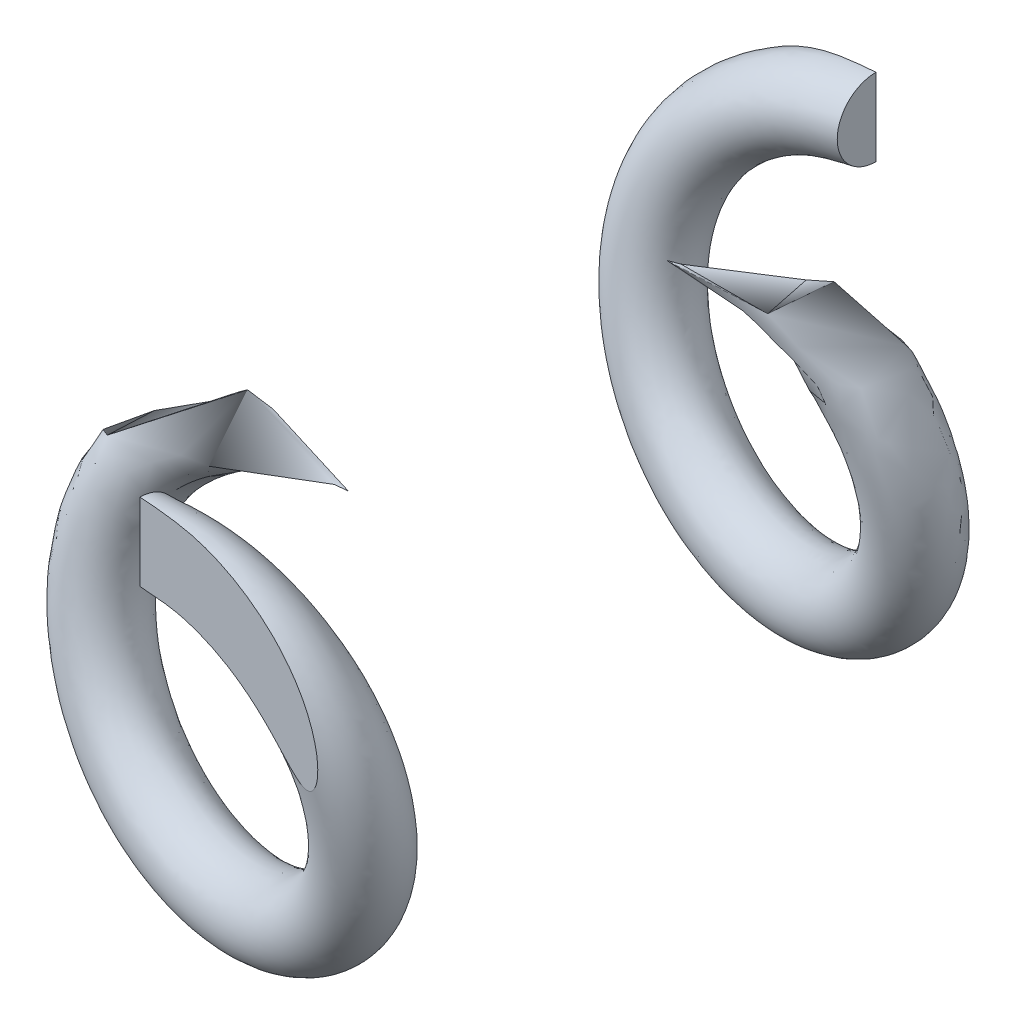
ISO-10303-21;
HEADER;
FILE_DESCRIPTION(('STEP AP214'),'2;1');
FILE_NAME('part.step','',(''),(''),'','','');
FILE_SCHEMA(('AUTOMOTIVE_DESIGN { 1 0 10303 214 1 1 1 1 }'));
ENDSEC;
DATA;
#1=APPLICATION_CONTEXT('core data for automotive mechanical design processes');
#2=APPLICATION_PROTOCOL_DEFINITION('international standard','automotive_design',2000,#1);
#3=PRODUCT_CONTEXT('',#1,'mechanical');
#4=PRODUCT('Part','Part','',(#3));
#5=PRODUCT_RELATED_PRODUCT_CATEGORY('part','',(#4));
#6=PRODUCT_DEFINITION_FORMATION('','',#4);
#7=PRODUCT_DEFINITION_CONTEXT('part definition',#1,'design');
#8=PRODUCT_DEFINITION('design','',#6,#7);
#9=PRODUCT_DEFINITION_SHAPE('','',#8);
#10=(LENGTH_UNIT() NAMED_UNIT(*) SI_UNIT(.MILLI.,.METRE.));
#11=(NAMED_UNIT(*) PLANE_ANGLE_UNIT() SI_UNIT($,.RADIAN.));
#12=(NAMED_UNIT(*) SI_UNIT($,.STERADIAN.) SOLID_ANGLE_UNIT());
#13=UNCERTAINTY_MEASURE_WITH_UNIT(LENGTH_MEASURE(1.E-05),#10,'distance_accuracy_value','');
#14=(GEOMETRIC_REPRESENTATION_CONTEXT(3) GLOBAL_UNCERTAINTY_ASSIGNED_CONTEXT((#13)) GLOBAL_UNIT_ASSIGNED_CONTEXT((#10,
#11,#12)) REPRESENTATION_CONTEXT('',''));
#15=CARTESIAN_POINT('',(0.,0.,0.));
#16=DIRECTION('',(0.,0.,1.));
#17=DIRECTION('',(1.,0.,0.));
#18=AXIS2_PLACEMENT_3D('',#15,#16,#17);
#19=CARTESIAN_POINT('',(0.,8.99999999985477,1.99999285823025));
#20=DIRECTION('',(-1.,0.,0.));
#21=DIRECTION('',(0.,0.,1.));
#22=AXIS2_PLACEMENT_3D('',#19,#20,#21);
#23=PLANE('',#22);
#24=DIRECTION('',(0.,-1.,0.));
#25=VECTOR('',#24,1.);
#26=CARTESIAN_POINT('',(0.,8.99999999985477,0.));
#27=LINE('',#26,#25);
#28=CARTESIAN_POINT('',(2.46419197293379E-10,10.9999999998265,0.));
#29=VERTEX_POINT('',#28);
#30=CARTESIAN_POINT('',(0.,6.99999999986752,0.));
#31=VERTEX_POINT('',#30);
#32=EDGE_CURVE('E373',#29,#31,#27,.T.);
#33=ORIENTED_EDGE('',*,*,#32,.F.);
#34=CARTESIAN_POINT('',(0.,8.99999999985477,-7.14176975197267E-06));
#35=DIRECTION('',(1.,0.,0.));
#36=DIRECTION('',(0.,0.,-1.));
#37=AXIS2_PLACEMENT_3D('',#34,#35,#36);
#38=CIRCLE('',#37,2.);
#39=EDGE_CURVE('E384',#31,#29,#38,.T.);
#40=ORIENTED_EDGE('',*,*,#39,.F.);
#41=EDGE_LOOP('',(#33,#40));
#42=FACE_BOUND('',#41,.T.);
#43=ADVANCED_FACE('F348',(#42),#23,.T.);
#44=CARTESIAN_POINT('',(-2.46359602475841E-08,9.00076589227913,-36.0000072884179));
#45=DIRECTION('',(-0.999999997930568,-6.43340002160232E-05,1.23182692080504E-08));
#46=DIRECTION('',(6.43340002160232E-05,-0.999999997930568,0.));
#47=AXIS2_PLACEMENT_3D('',#44,#45,#46);
#48=PLANE('',#47);
#49=CARTESIAN_POINT('',(6.02545463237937E-13,8.99999999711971,-38.000007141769));
#50=DIRECTION('',(-0.999999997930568,-6.43340002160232E-05,1.23182692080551E-08));
#51=DIRECTION('',(6.43340002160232E-05,-0.999999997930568,0.));
#52=AXIS2_PLACEMENT_3D('',#49,#50,#51);
#53=CIRCLE('',#52,2.);
#54=CARTESIAN_POINT('',(0.000128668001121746,7.00000000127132,-38.));
#55=VERTEX_POINT('',#54);
#56=CARTESIAN_POINT('',(-0.000128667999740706,10.9999999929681,-38.));
#57=VERTEX_POINT('',#56);
#58=EDGE_CURVE('E382',#55,#57,#53,.T.);
#59=ORIENTED_EDGE('',*,*,#58,.F.);
#60=DIRECTION('',(-6.43340002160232E-05,0.999999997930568,0.));
#61=VECTOR('',#60,1.);
#62=CARTESIAN_POINT('',(-4.92724088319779E-08,9.00076589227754,-38.));
#63=LINE('',#62,#61);
#64=EDGE_CURVE('E366',#55,#57,#63,.T.);
#65=ORIENTED_EDGE('',*,*,#64,.T.);
#66=EDGE_LOOP('',(#59,#65));
#67=FACE_BOUND('',#66,.T.);
#68=ADVANCED_FACE('F350',(#67),#48,.F.);
#69=CARTESIAN_POINT('',(0.,8.99999999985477,-2.00000714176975));
#70=CARTESIAN_POINT('',(0.784543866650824,8.94016528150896,-2.13179611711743));
#71=CARTESIAN_POINT('',(2.3553867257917,8.82036198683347,-2.39566889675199));
#72=CARTESIAN_POINT('',(4.55066460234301,7.8752242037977,-2.7916995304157));
#73=CARTESIAN_POINT('',(6.43729329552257,6.43925106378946,-3.18752068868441));
#74=CARTESIAN_POINT('',(7.88352715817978,4.55095446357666,-3.58328072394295));
#75=CARTESIAN_POINT('',(8.79139256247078,2.35571704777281,-3.97922788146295));
#76=CARTESIAN_POINT('',(9.10347168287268,0.000160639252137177,-4.37500204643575));
#77=CARTESIAN_POINT('',(8.79293363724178,-2.35614083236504,-4.77080364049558));
#78=CARTESIAN_POINT('',(7.88218659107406,-4.55087107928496,-5.16670860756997));
#79=CARTESIAN_POINT('',(6.43716516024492,-6.43689541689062,-5.56250884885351));
#80=CARTESIAN_POINT('',(4.55150843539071,-7.88360204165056,-5.95830593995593));
#81=CARTESIAN_POINT('',(2.35560351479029,-8.7915213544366,-6.35420533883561));
#82=CARTESIAN_POINT('',(0.000187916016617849,-9.10331476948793,-6.75001001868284));
#83=CARTESIAN_POINT('',(-2.35614483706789,-8.79295345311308,-7.14580610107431));
#84=CARTESIAN_POINT('',(-4.55088270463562,-7.88220987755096,-7.54170502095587));
#85=CARTESIAN_POINT('',(-6.43688140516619,-6.4371468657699,-7.93751013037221));
#86=CARTESIAN_POINT('',(-7.88360312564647,-4.55151127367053,-8.33330610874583));
#87=CARTESIAN_POINT('',(-8.79152427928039,-2.35560406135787,-8.72920499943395));
#88=CARTESIAN_POINT('',(-9.10331254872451,-0.000187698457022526,-9.12501013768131));
#89=CARTESIAN_POINT('',(-8.79295373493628,2.3561447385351,-9.52080610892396));
#90=CARTESIAN_POINT('',(-7.88221004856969,4.55088283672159,-9.91670499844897));
#91=CARTESIAN_POINT('',(-6.43714675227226,6.43688130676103,-10.3125101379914));
#92=CARTESIAN_POINT('',(-4.55151129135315,7.8836031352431,-10.7083061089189));
#93=CARTESIAN_POINT('',(-2.35560406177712,8.79152429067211,-11.1042049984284));
#94=CARTESIAN_POINT('',(-0.000187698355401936,9.10331254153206,-11.5000101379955));
#95=CARTESIAN_POINT('',(2.35614473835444,8.79295373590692,-11.8958061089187));
#96=CARTESIAN_POINT('',(4.55088283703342,7.88221004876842,-12.2917049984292));
#97=CARTESIAN_POINT('',(6.43688130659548,6.4371467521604,-12.687510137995));
#98=CARTESIAN_POINT('',(7.88360313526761,4.55151129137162,-13.0833061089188));
#99=CARTESIAN_POINT('',(8.79152429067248,2.35560406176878,-13.4792049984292));
#100=CARTESIAN_POINT('',(9.10331254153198,0.000187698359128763,-13.875010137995));
#101=CARTESIAN_POINT('',(8.79295373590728,-2.35614473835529,-14.2708061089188));
#102=CARTESIAN_POINT('',(7.88221004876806,-4.55088283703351,-14.6667049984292));
#103=CARTESIAN_POINT('',(6.43714675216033,-6.43688130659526,-15.062510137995));
#104=CARTESIAN_POINT('',(4.55151129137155,-7.8836031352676,-15.4583061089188));
#105=CARTESIAN_POINT('',(2.35560406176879,-8.7915242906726,-15.8542049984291));
#106=CARTESIAN_POINT('',(0.000187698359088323,-9.10331254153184,-16.250010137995));
#107=CARTESIAN_POINT('',(-2.3561447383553,-8.79295373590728,-16.6458061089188));
#108=CARTESIAN_POINT('',(-4.55088283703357,-7.88221004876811,-17.0417049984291));
#109=CARTESIAN_POINT('',(-6.43688130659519,-6.43714675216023,-17.437510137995));
#110=CARTESIAN_POINT('',(-7.88360313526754,-4.55151129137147,-17.8333061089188));
#111=CARTESIAN_POINT('',(-8.79152429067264,-2.3556040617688,-18.2292049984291));
#112=CARTESIAN_POINT('',(-9.10331254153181,-0.000187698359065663,-18.625010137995));
#113=CARTESIAN_POINT('',(-8.79295373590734,2.35614473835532,-19.0208061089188));
#114=CARTESIAN_POINT('',(-7.88221004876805,4.55088283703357,-19.4167049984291));
#115=CARTESIAN_POINT('',(-6.43714675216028,6.43688130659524,-19.812510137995));
#116=CARTESIAN_POINT('',(-4.55151129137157,7.8836031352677,-20.2083061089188));
#117=CARTESIAN_POINT('',(-2.35560406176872,8.79152429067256,-20.6042049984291));
#118=CARTESIAN_POINT('',(-0.000187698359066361,9.10331254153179,-21.000010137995));
#119=CARTESIAN_POINT('',(2.35614473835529,8.79295373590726,-21.3958061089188));
#120=CARTESIAN_POINT('',(4.55088283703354,7.88221004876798,-21.7917049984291));
#121=CARTESIAN_POINT('',(6.4368813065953,6.43714675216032,-22.187510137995));
#122=CARTESIAN_POINT('',(7.8836031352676,4.55151129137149,-22.5833061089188));
#123=CARTESIAN_POINT('',(8.79152429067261,2.35560406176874,-22.9792049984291));
#124=CARTESIAN_POINT('',(9.1033125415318,0.000187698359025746,-23.375010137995));
#125=CARTESIAN_POINT('',(8.79295373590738,-2.35614473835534,-23.7708061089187));
#126=CARTESIAN_POINT('',(7.88221004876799,-4.55088283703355,-24.1667049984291));
#127=CARTESIAN_POINT('',(6.4371467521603,-6.43688130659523,-24.562510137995));
#128=CARTESIAN_POINT('',(4.55151129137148,-7.88360313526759,-24.9583061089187));
#129=CARTESIAN_POINT('',(2.35560406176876,-8.79152429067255,-25.3542049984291));
#130=CARTESIAN_POINT('',(0.000187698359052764,-9.10331254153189,-25.750010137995));
#131=CARTESIAN_POINT('',(-2.35614473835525,-8.79295373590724,-26.1458061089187));
#132=CARTESIAN_POINT('',(-4.55088283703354,-7.88221004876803,-26.5417049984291));
#133=CARTESIAN_POINT('',(-6.43688130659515,-6.43714675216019,-26.9375101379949));
#134=CARTESIAN_POINT('',(-7.88360313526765,-4.5515112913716,-27.3333061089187));
#135=CARTESIAN_POINT('',(-8.79152429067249,-2.3556040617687,-27.7292049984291));
#136=CARTESIAN_POINT('',(-9.10331254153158,-0.000187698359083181,-28.125010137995));
#137=CARTESIAN_POINT('',(-8.79295373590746,2.3561447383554,-28.5208061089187));
#138=CARTESIAN_POINT('',(-7.8822100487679,4.55088283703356,-28.9167049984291));
#139=CARTESIAN_POINT('',(-6.4371467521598,6.43688130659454,-29.3125101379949));
#140=CARTESIAN_POINT('',(-4.55151129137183,7.88360313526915,-29.7083061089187));
#141=CARTESIAN_POINT('',(-2.35560406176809,8.79152429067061,-30.1042049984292));
#142=CARTESIAN_POINT('',(-0.000187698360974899,9.10331254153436,-30.5000101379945));
#143=CARTESIAN_POINT('',(2.35614473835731,8.79295373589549,-30.8958061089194));
#144=CARTESIAN_POINT('',(4.55088283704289,7.88221004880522,-31.2917049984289));
#145=CARTESIAN_POINT('',(6.4368813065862,6.43714675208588,-31.6875101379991));
#146=CARTESIAN_POINT('',(7.88360313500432,4.55151129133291,-32.0833061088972));
#147=CARTESIAN_POINT('',(8.79152429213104,2.3556040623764,-32.4792049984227));
#148=CARTESIAN_POINT('',(9.10331253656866,0.00018769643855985,-32.8750101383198));
#149=CARTESIAN_POINT('',(8.79295373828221,-2.35614473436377,-33.2708061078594));
#150=CARTESIAN_POINT('',(7.88221007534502,-4.55088285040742,-33.6667049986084));
#151=CARTESIAN_POINT('',(6.43714663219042,-6.43688123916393,-34.0625101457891));
#152=CARTESIAN_POINT('',(4.55151143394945,-7.88360320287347,-34.4583060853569));
#153=CARTESIAN_POINT('',(2.35560414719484,-8.79152464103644,-34.8542050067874));
#154=CARTESIAN_POINT('',(0.00018721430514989,-9.10331027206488,-35.2500102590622));
#155=CARTESIAN_POINT('',(-2.35614435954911,-8.79295696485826,-35.6458057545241));
#156=CARTESIAN_POINT('',(-4.5508846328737,-7.8822122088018,-36.0417051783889));
#157=CARTESIAN_POINT('',(-6.43686412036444,-6.43712320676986,-36.4375114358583));
#158=CARTESIAN_POINT('',(-7.88363802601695,-4.55154660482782,-36.833302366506));
#159=CARTESIAN_POINT('',(-8.79152358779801,-2.35558247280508,-37.2292076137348));
#160=CARTESIAN_POINT('',(-9.103075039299,-0.000220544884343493,-37.6250181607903));
#161=CARTESIAN_POINT('',(-8.7934146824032,2.3563843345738,-38.0207825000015));
#162=CARTESIAN_POINT('',(-7.88186494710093,4.55024037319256,-38.4167315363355));
#163=CARTESIAN_POINT('',(-6.43668902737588,6.43809215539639,-38.8124980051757));
#164=CARTESIAN_POINT('',(-4.55219606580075,7.87816013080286,-39.2083117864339));
#165=CARTESIAN_POINT('',(-2.35457400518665,8.81776790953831,-39.6043429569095));
#166=CARTESIAN_POINT('',(-0.784270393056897,8.93879065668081,-39.8682177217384));
#167=CARTESIAN_POINT('',(2.46371653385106E-08,8.99923410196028,-40.0000069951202));
#168=CARTESIAN_POINT('',(0.,12.9999999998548,-2.00000714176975));
#169=CARTESIAN_POINT('',(1.13193830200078,12.91401560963,-2.13114161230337));
#170=CARTESIAN_POINT('',(3.39834719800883,12.7418544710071,-2.39370391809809));
#171=CARTESIAN_POINT('',(6.57482829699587,11.375849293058,-2.79578290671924));
#172=CARTESIAN_POINT('',(9.29973831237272,9.29878914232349,-3.18701948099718));
#173=CARTESIAN_POINT('',(11.3852652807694,6.57752424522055,-3.58228901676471));
#174=CARTESIAN_POINT('',(12.7006368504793,3.40024402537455,-3.98209013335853));
#175=CARTESIAN_POINT('',(13.1488753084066,3.23310086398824E-05,-4.3753685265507));
#176=CARTESIAN_POINT('',(12.7020847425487,-3.40029337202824,-4.77009602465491));
#177=CARTESIAN_POINT('',(11.3849020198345,-6.57641680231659,-5.16903773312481));
#178=CARTESIAN_POINT('',(9.29781059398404,-9.29738510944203,-5.56322365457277));
#179=CARTESIAN_POINT('',(6.57727209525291,-11.3861781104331,-5.95758581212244));
#180=CARTESIAN_POINT('',(3.40013139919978,-12.7005786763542,-6.35646828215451));
#181=CARTESIAN_POINT('',(0.000309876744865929,-13.148771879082,-6.75077149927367));
#182=CARTESIAN_POINT('',(-3.40041378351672,-12.7020786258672,-7.1450813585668));
#183=CARTESIAN_POINT('',(-6.57641022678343,-11.3849235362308,-7.54396248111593));
#184=CARTESIAN_POINT('',(-9.29736520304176,-9.29780353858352,-7.93827573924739));
#185=CARTESIAN_POINT('',(-11.3861816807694,-6.57727055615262,-8.33258081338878));
#186=CARTESIAN_POINT('',(-12.7005811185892,-3.40013237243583,-8.73146213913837));
#187=CARTESIAN_POINT('',(-13.1487697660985,-0.00030991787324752,-9.12577600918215));
#188=CARTESIAN_POINT('',(-12.7020789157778,3.40041363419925,-9.52008077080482));
#189=CARTESIAN_POINT('',(-11.3849236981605,6.57641039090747,-9.91896212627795));
#190=CARTESIAN_POINT('',(-9.29780340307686,9.29736511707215,-10.313276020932));
#191=CARTESIAN_POINT('',(-6.5772706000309,11.3861816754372,-10.7075807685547));
#192=CARTESIAN_POINT('',(-3.40013236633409,12.7005811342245,-11.1064621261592));
#193=CARTESIAN_POINT('',(-0.000309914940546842,13.1487697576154,-11.500776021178));
#194=CARTESIAN_POINT('',(3.40041363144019,12.7020789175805,-11.8950807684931));
#195=CARTESIAN_POINT('',(6.57641039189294,11.384923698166,-12.2939621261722));
#196=CARTESIAN_POINT('',(9.2973651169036,9.29780340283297,-12.6882760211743));
#197=CARTESIAN_POINT('',(11.3861816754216,6.5772706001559,-13.0825807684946));
#198=CARTESIAN_POINT('',(12.7005811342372,3.4001323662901,-13.481462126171));
#199=CARTESIAN_POINT('',(13.1487697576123,0.00030991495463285,-13.8757760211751));
#200=CARTESIAN_POINT('',(12.7020789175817,-3.4004136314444,-14.2700807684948));
#201=CARTESIAN_POINT('',(11.3849236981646,-6.57641039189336,-14.6689621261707));
#202=CARTESIAN_POINT('',(9.29780340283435,-9.29736511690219,-15.0632760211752));
#203=CARTESIAN_POINT('',(6.57727060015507,-11.3861816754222,-15.4575807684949));
#204=CARTESIAN_POINT('',(3.40013236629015,-12.7005811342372,-15.8564621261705));
#205=CARTESIAN_POINT('',(0.000309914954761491,-13.1487697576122,-16.2507760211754));
#206=CARTESIAN_POINT('',(-3.40041363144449,-12.7020789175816,-16.6450807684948));
#207=CARTESIAN_POINT('',(-6.57641039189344,-11.3849236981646,-17.0439621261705));
#208=CARTESIAN_POINT('',(-9.2973651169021,-9.29780340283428,-17.4382760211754));
#209=CARTESIAN_POINT('',(-11.3861816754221,-6.577270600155,-17.832580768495));
#210=CARTESIAN_POINT('',(-12.7005811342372,-3.40013236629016,-18.2314621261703));
#211=CARTESIAN_POINT('',(-13.1487697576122,-0.000309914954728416,-18.6257760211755));
#212=CARTESIAN_POINT('',(-12.7020789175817,3.40041363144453,-19.0200807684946));
#213=CARTESIAN_POINT('',(-11.3849236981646,6.57641039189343,-19.4189621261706));
#214=CARTESIAN_POINT('',(-9.29780340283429,9.29736511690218,-19.8132760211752));
#215=CARTESIAN_POINT('',(-6.57727060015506,11.3861816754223,-20.2075807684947));
#216=CARTESIAN_POINT('',(-3.40013236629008,12.7005811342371,-20.6064621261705));
#217=CARTESIAN_POINT('',(-0.000309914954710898,13.1487697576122,-21.0007760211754));
#218=CARTESIAN_POINT('',(3.40041363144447,12.7020789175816,-21.3950807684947));
#219=CARTESIAN_POINT('',(6.57641039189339,11.3849236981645,-21.7939621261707));
#220=CARTESIAN_POINT('',(9.29736511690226,9.29780340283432,-22.1882760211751));
#221=CARTESIAN_POINT('',(11.3861816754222,6.57727060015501,-22.5825807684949));
#222=CARTESIAN_POINT('',(12.7005811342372,3.40013236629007,-22.9814621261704));
#223=CARTESIAN_POINT('',(13.1487697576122,0.000309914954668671,-23.3757760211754));
#224=CARTESIAN_POINT('',(12.7020789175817,-3.40041363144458,-23.7700807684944));
#225=CARTESIAN_POINT('',(11.3849236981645,-6.5764103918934,-24.1689621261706));
#226=CARTESIAN_POINT('',(9.29780340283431,-9.29736511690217,-24.5632760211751));
#227=CARTESIAN_POINT('',(6.577270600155,-11.3861816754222,-24.9575807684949));
#228=CARTESIAN_POINT('',(3.40013236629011,-12.7005811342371,-25.3564621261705));
#229=CARTESIAN_POINT('',(0.000309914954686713,-13.1487697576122,-25.7507760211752));
#230=CARTESIAN_POINT('',(-3.40041363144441,-12.7020789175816,-26.1450807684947));
#231=CARTESIAN_POINT('',(-6.5764103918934,-11.3849236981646,-26.5439621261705));
#232=CARTESIAN_POINT('',(-9.29736511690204,-9.29780340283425,-26.9382760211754));
#233=CARTESIAN_POINT('',(-11.3861816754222,-6.5772706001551,-27.3325807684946));
#234=CARTESIAN_POINT('',(-12.7005811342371,-3.40013236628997,-27.7314621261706));
#235=CARTESIAN_POINT('',(-13.1487697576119,-0.000309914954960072,-28.1257760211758));
#236=CARTESIAN_POINT('',(-12.702078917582,3.40041363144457,-28.5200807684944));
#237=CARTESIAN_POINT('',(-11.3849236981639,6.5764103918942,-28.9189621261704));
#238=CARTESIAN_POINT('',(-9.29780340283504,9.2973651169,-29.3132760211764));
#239=CARTESIAN_POINT('',(-6.57727060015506,11.3861816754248,-29.7075807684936));
#240=CARTESIAN_POINT('',(-3.40013236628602,12.7005811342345,-30.1064621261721));
#241=CARTESIAN_POINT('',(-0.000309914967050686,13.1487697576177,-30.5007760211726));
#242=CARTESIAN_POINT('',(3.40041363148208,12.7020789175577,-30.895080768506));
#243=CARTESIAN_POINT('',(6.57641039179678,11.3849236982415,-31.2939621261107));
#244=CARTESIAN_POINT('',(9.29736511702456,9.29780340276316,-31.688276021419));
#245=CARTESIAN_POINT('',(11.38618167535,6.57727059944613,-32.0825807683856));
#246=CARTESIAN_POINT('',(12.7005811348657,3.40013236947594,-32.4814621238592));
#247=CARTESIAN_POINT('',(13.1487697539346,0.000309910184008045,-32.8757760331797));
#248=CARTESIAN_POINT('',(12.702078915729,-3.40041363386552,-33.2700807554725));
#249=CARTESIAN_POINT('',(11.3849237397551,-6.57641037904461,-33.668962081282));
#250=CARTESIAN_POINT('',(9.29780326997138,-9.29736507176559,-34.0632763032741));
#251=CARTESIAN_POINT('',(6.57727071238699,-11.3861817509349,-34.457580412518));
#252=CARTESIAN_POINT('',(3.40013250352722,-12.7005814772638,-34.8564615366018));
#253=CARTESIAN_POINT('',(0.000309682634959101,-13.1487673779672,-35.2507805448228));
#254=CARTESIAN_POINT('',(-3.40041279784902,-12.7020826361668,-35.6450745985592));
#255=CARTESIAN_POINT('',(-6.57641657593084,-11.3849233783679,-36.0439570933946));
#256=CARTESIAN_POINT('',(-9.29733669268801,-9.29778569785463,-36.4383283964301));
#257=CARTESIAN_POINT('',(-11.3862182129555,-6.57732439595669,-36.8325050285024));
#258=CARTESIAN_POINT('',(-12.7006065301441,-3.39999400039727,-37.2314470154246));
#259=CARTESIAN_POINT('',(-13.1484783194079,-0.000593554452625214,-37.6261834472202));
#260=CARTESIAN_POINT('',(-12.7027282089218,3.40065038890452,-38.0194520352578));
#261=CARTESIAN_POINT('',(-11.3837363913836,6.57658116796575,-38.4192550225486));
#262=CARTESIAN_POINT('',(-9.29930935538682,9.29745374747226,-38.8145309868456));
#263=CARTESIAN_POINT('',(-6.57659080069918,11.378651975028,-39.2057601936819));
#264=CARTESIAN_POINT('',(-3.39779209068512,12.7391914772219,-39.607839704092));
#265=CARTESIAN_POINT('',(-1.13192103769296,12.9126179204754,-39.8704040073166));
#266=CARTESIAN_POINT('',(-0.000257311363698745,12.9992338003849,-40.001538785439));
#267=CARTESIAN_POINT('',(0.,12.9999999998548,1.99999285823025));
#268=CARTESIAN_POINT('',(1.13172989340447,12.9134022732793,1.86885845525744));
#269=CARTESIAN_POINT('',(3.39772150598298,12.7400130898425,1.60629628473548));
#270=CARTESIAN_POINT('',(6.57673556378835,11.3794647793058,1.20421597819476));
#271=CARTESIAN_POINT('',(9.29970111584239,9.29815943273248,0.81298077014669));
#272=CARTESIAN_POINT('',(11.3842655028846,6.57720586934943,0.41771106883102));
#273=CARTESIAN_POINT('',(12.7034046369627,3.40113304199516,0.0179092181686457));
#274=CARTESIAN_POINT('',(13.1492536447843,-0.000384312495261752,-0.375368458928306));
#275=CARTESIAN_POINT('',(12.7014241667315,-3.39991762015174,-0.770095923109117));
#276=CARTESIAN_POINT('',(11.3870364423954,-6.57746564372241,-1.16903820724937));
#277=CARTESIAN_POINT('',(9.29803181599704,-9.29818615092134,-1.56322367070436));
#278=CARTESIAN_POINT('',(6.57704995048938,-11.3854469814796,-1.95758569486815));
#279=CARTESIAN_POINT('',(3.40089058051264,-12.7027614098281,-2.35646873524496));
#280=CARTESIAN_POINT('',(-0.000101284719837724,-13.1495419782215,-2.75077152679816));
#281=CARTESIAN_POINT('',(-3.40005478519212,-12.7013996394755,-3.14508123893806));
#282=CARTESIAN_POINT('',(-6.57741292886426,-11.3869995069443,-3.54396293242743));
#283=CARTESIAN_POINT('',(-9.29820362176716,-9.29806015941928,-3.93827576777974));
#284=CARTESIAN_POINT('',(-11.3854473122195,-6.57704386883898,-4.33258069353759));
#285=CARTESIAN_POINT('',(-12.7027577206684,-3.40089130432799,-4.73146259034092));
#286=CARTESIAN_POINT('',(-13.1495443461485,0.000101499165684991,-5.12577603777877));
#287=CARTESIAN_POINT('',(-12.7013993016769,3.40005464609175,-5.52008065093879));
#288=CARTESIAN_POINT('',(-11.3869994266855,6.57741282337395,-5.91896257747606));
#289=CARTESIAN_POINT('',(-9.29806020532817,9.29820375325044,-6.3132760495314));
#290=CARTESIAN_POINT('',(-6.57704388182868,11.3854472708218,-6.70758064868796));
#291=CARTESIAN_POINT('',(-3.40089130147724,12.7027577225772,-7.10646257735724));
#292=CARTESIAN_POINT('',(0.000101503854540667,13.1495443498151,-7.50077604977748));
#293=CARTESIAN_POINT('',(3.40005464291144,12.7013993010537,-7.89508064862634));
#294=CARTESIAN_POINT('',(6.57741282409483,11.38699942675,-8.2939625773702));
#295=CARTESIAN_POINT('',(9.29820375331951,9.29806020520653,-8.68827604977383));
#296=CARTESIAN_POINT('',(11.3854472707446,6.57704388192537,-9.08258064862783));
#297=CARTESIAN_POINT('',(12.7027577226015,3.40089130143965,-9.48146257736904));
#298=CARTESIAN_POINT('',(13.1495443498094,-0.000101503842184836,-9.87577604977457));
#299=CARTESIAN_POINT('',(12.7013993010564,-3.40005464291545,-10.2700806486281));
#300=CARTESIAN_POINT('',(11.3869994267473,-6.57741282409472,-10.6689625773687));
#301=CARTESIAN_POINT('',(9.29806020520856,-9.29820375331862,-11.0632760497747));
#302=CARTESIAN_POINT('',(6.57704388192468,-11.3854472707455,-11.4575806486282));
#303=CARTESIAN_POINT('',(3.40089130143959,-12.702757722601,-11.8564625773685));
#304=CARTESIAN_POINT('',(-0.000101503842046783,-13.1495443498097,-12.2507760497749));
#305=CARTESIAN_POINT('',(-3.40005464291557,-12.7013993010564,-12.645080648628));
#306=CARTESIAN_POINT('',(-6.57741282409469,-11.3869994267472,-13.0439625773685));
#307=CARTESIAN_POINT('',(-9.29820375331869,-9.29806020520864,-13.4382760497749));
#308=CARTESIAN_POINT('',(-11.3854472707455,-6.57704388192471,-13.8325806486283));
#309=CARTESIAN_POINT('',(-12.7027577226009,-3.40089130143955,-14.2314625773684));
#310=CARTESIAN_POINT('',(-13.1495443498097,0.000101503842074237,-14.625776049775));
#311=CARTESIAN_POINT('',(-12.7013993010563,3.40005464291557,-15.0200806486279));
#312=CARTESIAN_POINT('',(-11.3869994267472,6.57741282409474,-15.4189625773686));
#313=CARTESIAN_POINT('',(-9.29806020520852,9.29820375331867,-15.8132760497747));
#314=CARTESIAN_POINT('',(-6.57704388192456,11.3854472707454,-16.2075806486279));
#315=CARTESIAN_POINT('',(-3.40089130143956,12.702757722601,-16.6064625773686));
#316=CARTESIAN_POINT('',(0.000101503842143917,13.1495443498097,-17.0007760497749));
#317=CARTESIAN_POINT('',(3.40005464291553,12.7013993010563,-17.395080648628));
#318=CARTESIAN_POINT('',(6.5774128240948,11.3869994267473,-17.7939625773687));
#319=CARTESIAN_POINT('',(9.2982037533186,9.29806020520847,-18.1882760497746));
#320=CARTESIAN_POINT('',(11.3854472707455,6.57704388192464,-18.5825806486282));
#321=CARTESIAN_POINT('',(12.702757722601,3.40089130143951,-18.9814625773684));
#322=CARTESIAN_POINT('',(13.1495443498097,-0.000101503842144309,-19.3757760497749));
#323=CARTESIAN_POINT('',(12.7013993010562,-3.4000546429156,-19.7700806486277));
#324=CARTESIAN_POINT('',(11.3869994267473,-6.57741282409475,-20.1689625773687));
#325=CARTESIAN_POINT('',(9.29806020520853,-9.29820375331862,-20.5632760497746));
#326=CARTESIAN_POINT('',(6.57704388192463,-11.3854472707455,-20.9575806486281));
#327=CARTESIAN_POINT('',(3.40089130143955,-12.702757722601,-21.3564625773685));
#328=CARTESIAN_POINT('',(-0.000101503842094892,-13.1495443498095,-21.7507760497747));
#329=CARTESIAN_POINT('',(-3.40005464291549,-12.7013993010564,-22.145080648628));
#330=CARTESIAN_POINT('',(-6.5774128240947,-11.3869994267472,-22.5439625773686));
#331=CARTESIAN_POINT('',(-9.29820375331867,-9.29806020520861,-22.9382760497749));
#332=CARTESIAN_POINT('',(-11.3854472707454,-6.57704388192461,-23.3325806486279));
#333=CARTESIAN_POINT('',(-12.702757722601,-3.40089130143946,-23.7314625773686));
#334=CARTESIAN_POINT('',(-13.1495443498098,0.000101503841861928,-24.1257760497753));
#335=CARTESIAN_POINT('',(-12.7013993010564,3.40005464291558,-24.5200806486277));
#336=CARTESIAN_POINT('',(-11.3869994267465,6.57741282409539,-24.9189625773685));
#337=CARTESIAN_POINT('',(-9.29806020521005,9.29820375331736,-25.3132760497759));
#338=CARTESIAN_POINT('',(-6.57704388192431,11.385447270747,-25.7075806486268));
#339=CARTESIAN_POINT('',(-3.40089130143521,12.7027577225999,-26.1064625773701));
#340=CARTESIAN_POINT('',(0.000101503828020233,13.1495443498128,-26.5007760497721));
#341=CARTESIAN_POINT('',(3.40005464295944,12.7013993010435,-26.8950806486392));
#342=CARTESIAN_POINT('',(6.57741282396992,11.3869994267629,-27.2939625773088));
#343=CARTESIAN_POINT('',(9.29820375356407,9.29806020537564,-27.6882760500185));
#344=CARTESIAN_POINT('',(11.3854472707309,6.57704388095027,-28.0825806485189));
#345=CARTESIAN_POINT('',(12.7027577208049,3.40089130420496,-28.4814625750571));
#346=CARTESIAN_POINT('',(13.14954435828,-0.000101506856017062,-28.8757760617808));
#347=CARTESIAN_POINT('',(12.7013992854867,-3.4000546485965,-29.2700806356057));
#348=CARTESIAN_POINT('',(11.3869994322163,-6.57741278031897,-29.6689625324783));
#349=CARTESIAN_POINT('',(9.29806029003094,-9.29820388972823,-30.0632763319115));
#350=CARTESIAN_POINT('',(6.57704372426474,-11.3854471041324,-30.4575802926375));
#351=CARTESIAN_POINT('',(3.40089144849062,-12.7027574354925,-30.8564619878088));
#352=CARTESIAN_POINT('',(-0.000101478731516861,-13.1495464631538,-31.2507805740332));
#353=CARTESIAN_POINT('',(-3.40005356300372,-12.7013968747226,-31.6450744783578));
#354=CARTESIAN_POINT('',(-6.57741443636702,-11.3869958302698,-32.0439575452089));
#355=CARTESIAN_POINT('',(-9.29821090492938,-9.29808009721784,-32.4383284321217));
#356=CARTESIAN_POINT('',(-11.3854251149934,-6.57705127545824,-32.8325049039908));
#357=CARTESIAN_POINT('',(-12.702764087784,-3.40076965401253,-33.2314474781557));
#358=CARTESIAN_POINT('',(-13.1496491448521,-0.000177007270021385,-33.6261835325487));
#359=CARTESIAN_POINT('',(-12.7014574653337,3.40016131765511,-34.0194518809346));
#360=CARTESIAN_POINT('',(-11.3860771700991,6.57767556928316,-34.4192556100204));
#361=CARTESIAN_POINT('',(-9.30044274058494,9.29917846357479,-34.8145312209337));
#362=CARTESIAN_POINT('',(-6.57545872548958,11.3763770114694,-35.2057600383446));
#363=CARTESIAN_POINT('',(-3.39881722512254,12.7425345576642,-35.6078405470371));
#364=CARTESIAN_POINT('',(-1.13226252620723,12.9147530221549,-35.8704044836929));
#365=CARTESIAN_POINT('',(-0.000257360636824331,13.0007655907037,-36.0015390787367));
#366=CARTESIAN_POINT('',(0.,8.99999999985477,1.99999285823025));
#367=CARTESIAN_POINT('',(0.784335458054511,8.93955194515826,1.86820395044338));
#368=CARTESIAN_POINT('',(2.35476103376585,8.81852060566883,1.60433130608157));
#369=CARTESIAN_POINT('',(4.55257186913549,7.87883969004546,1.2082993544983));
#370=CARTESIAN_POINT('',(6.43725609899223,6.43862135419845,0.812479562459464));
#371=CARTESIAN_POINT('',(7.88252738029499,4.55063608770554,0.416719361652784));
#372=CARTESIAN_POINT('',(8.79416034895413,2.35660606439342,0.0207714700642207));
#373=CARTESIAN_POINT('',(9.10385001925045,-0.000256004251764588,-0.375001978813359));
#374=CARTESIAN_POINT('',(8.79227306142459,-2.35576508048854,-0.770803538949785));
#375=CARTESIAN_POINT('',(7.88432101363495,-4.55191992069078,-1.16670908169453));
#376=CARTESIAN_POINT('',(6.43738638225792,-6.43769645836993,-1.56250886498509));
#377=CARTESIAN_POINT('',(4.55128629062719,-7.88287091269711,-1.95830582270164));
#378=CARTESIAN_POINT('',(2.35636269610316,-8.79370408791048,-2.35420579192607));
#379=CARTESIAN_POINT('',(-0.000223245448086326,-9.10408486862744,-2.75001004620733));
#380=CARTESIAN_POINT('',(-2.35578583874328,-8.79227446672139,-3.14580598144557));
#381=CARTESIAN_POINT('',(-4.55188540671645,-7.8842858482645,-3.54170547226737));
#382=CARTESIAN_POINT('',(-6.43771982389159,-6.43740348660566,-3.93751015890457));
#383=CARTESIAN_POINT('',(-7.88286875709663,-4.5512845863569,-4.33330598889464));
#384=CARTESIAN_POINT('',(-8.79370088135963,-2.35636299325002,-4.72920545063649));
#385=CARTESIAN_POINT('',(-9.10408712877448,0.000223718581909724,-5.12501016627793));
#386=CARTESIAN_POINT('',(-8.79227412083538,2.35578575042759,-5.52080598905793));
#387=CARTESIAN_POINT('',(-7.88428577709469,4.55188526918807,-5.91670544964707));
#388=CARTESIAN_POINT('',(-6.43740355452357,6.43771994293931,-6.31251016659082));
#389=CARTESIAN_POINT('',(-4.55128457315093,7.88286873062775,-6.70830598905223));
#390=CARTESIAN_POINT('',(-2.35636299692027,8.79370087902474,-7.10420544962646));
#391=CARTESIAN_POINT('',(0.000223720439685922,9.10408713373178,-7.50001016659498));
#392=CARTESIAN_POINT('',(2.35578574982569,8.79227411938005,-7.89580598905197));
#393=CARTESIAN_POINT('',(4.55188526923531,7.88428577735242,-8.2917054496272));
#394=CARTESIAN_POINT('',(6.43771994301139,6.43740355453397,-8.68751016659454));
#395=CARTESIAN_POINT('',(7.88286873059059,4.55128457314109,-9.08330598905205));
#396=CARTESIAN_POINT('',(8.79370087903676,2.35636299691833,-9.47920544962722));
#397=CARTESIAN_POINT('',(9.1040871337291,-0.000223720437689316,-9.87501016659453));
#398=CARTESIAN_POINT('',(8.792274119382,-2.35578574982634,-10.2708059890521));
#399=CARTESIAN_POINT('',(7.88428577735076,-4.55188526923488,-10.6667054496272));
#400=CARTESIAN_POINT('',(6.43740355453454,-6.43771994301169,-11.0625101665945));
#401=CARTESIAN_POINT('',(4.55128457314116,-7.88286873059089,-11.4583059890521));
#402=CARTESIAN_POINT('',(2.35636299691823,-8.7937008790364,-11.8542054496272));
#403=CARTESIAN_POINT('',(-0.000223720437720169,-9.1040871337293,-12.2500101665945));
#404=CARTESIAN_POINT('',(-2.35578574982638,-8.792274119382,-12.6458059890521));
#405=CARTESIAN_POINT('',(-4.55188526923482,-7.88428577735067,-13.0417054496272));
#406=CARTESIAN_POINT('',(-6.43771994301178,-6.43740355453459,-13.4375101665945));
#407=CARTESIAN_POINT('',(-7.88286873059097,-4.55128457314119,-13.833305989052));
#408=CARTESIAN_POINT('',(-8.79370087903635,-2.35636299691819,-14.2292054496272));
#409=CARTESIAN_POINT('',(-9.10408713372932,0.000223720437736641,-14.6250101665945));
#410=CARTESIAN_POINT('',(-8.79227411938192,2.35578574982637,-15.020805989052));
#411=CARTESIAN_POINT('',(-7.8842857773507,4.55188526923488,-15.4167054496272));
#412=CARTESIAN_POINT('',(-6.43740355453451,6.43771994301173,-15.8125101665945));
#413=CARTESIAN_POINT('',(-4.55128457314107,7.88286873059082,-16.208305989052));
#414=CARTESIAN_POINT('',(-2.3563629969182,8.79370087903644,-16.6042054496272));
#415=CARTESIAN_POINT('',(0.000223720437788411,9.10408713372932,-17.0000101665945));
#416=CARTESIAN_POINT('',(2.35578574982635,8.79227411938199,-17.395805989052));
#417=CARTESIAN_POINT('',(4.55188526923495,7.88428577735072,-17.7917054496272));
#418=CARTESIAN_POINT('',(6.43771994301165,6.43740355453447,-18.1875101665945));
#419=CARTESIAN_POINT('',(7.88286873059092,4.55128457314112,-18.583305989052));
#420=CARTESIAN_POINT('',(8.79370087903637,2.35636299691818,-18.9792054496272));
#421=CARTESIAN_POINT('',(9.1040871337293,-0.000223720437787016,-19.3750101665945));
#422=CARTESIAN_POINT('',(8.79227411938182,-2.35578574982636,-19.770805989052));
#423=CARTESIAN_POINT('',(7.88428577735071,-4.55188526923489,-20.1667054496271));
#424=CARTESIAN_POINT('',(6.43740355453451,-6.43771994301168,-20.5625101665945));
#425=CARTESIAN_POINT('',(4.55128457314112,-7.8828687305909,-20.958305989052));
#426=CARTESIAN_POINT('',(2.3563629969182,-8.7937008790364,-21.3542054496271));
#427=CARTESIAN_POINT('',(-0.000223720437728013,-9.10408713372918,-21.7500101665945));
#428=CARTESIAN_POINT('',(-2.35578574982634,-8.79227411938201,-22.145805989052));
#429=CARTESIAN_POINT('',(-4.55188526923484,-7.88428577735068,-22.5417054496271));
#430=CARTESIAN_POINT('',(-6.43771994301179,-6.43740355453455,-22.9375101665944));
#431=CARTESIAN_POINT('',(-7.8828687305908,-4.55128457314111,-23.333305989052));
#432=CARTESIAN_POINT('',(-8.79370087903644,-2.35636299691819,-23.7292054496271));
#433=CARTESIAN_POINT('',(-9.10408713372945,0.000223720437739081,-24.1250101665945));
#434=CARTESIAN_POINT('',(-8.79227411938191,2.35578574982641,-24.5208059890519));
#435=CARTESIAN_POINT('',(-7.8842857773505,4.55188526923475,-24.9167054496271));
#436=CARTESIAN_POINT('',(-6.43740355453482,6.4377199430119,-25.3125101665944));
#437=CARTESIAN_POINT('',(-4.55128457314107,7.88286873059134,-25.708305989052));
#438=CARTESIAN_POINT('',(-2.35636299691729,8.79370087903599,-26.1042054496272));
#439=CARTESIAN_POINT('',(0.000223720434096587,9.10408713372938,-26.500010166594));
#440=CARTESIAN_POINT('',(2.35578574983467,8.79227411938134,-26.8958059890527));
#441=CARTESIAN_POINT('',(4.55188526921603,7.8842857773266,-27.2917054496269));
#442=CARTESIAN_POINT('',(6.4377199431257,6.43740355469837,-27.6875101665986));
#443=CARTESIAN_POINT('',(7.88286873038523,4.55128457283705,-28.0833059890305));
#444=CARTESIAN_POINT('',(8.79370087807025,2.35636299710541,-28.4792054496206));
#445=CARTESIAN_POINT('',(9.10408714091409,-0.00022372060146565,-28.8750101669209));
#446=CARTESIAN_POINT('',(8.7922741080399,-2.35578574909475,-29.2708059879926));
#447=CARTESIAN_POINT('',(7.88428576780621,-4.55188525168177,-29.6667054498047));
#448=CARTESIAN_POINT('',(6.43740365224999,-6.43772005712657,-30.0625101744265));
#449=CARTESIAN_POINT('',(4.5512844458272,-7.88286855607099,-30.4583059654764));
#450=CARTESIAN_POINT('',(2.35636309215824,-8.79370059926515,-30.8542054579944));
#451=CARTESIAN_POINT('',(-0.000223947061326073,-9.1040893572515,-31.2500102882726));
#452=CARTESIAN_POINT('',(-2.35578512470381,-8.79227120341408,-31.6458056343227));
#453=CARTESIAN_POINT('',(-4.55188249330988,-7.8842846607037,-32.0417056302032));
#454=CARTESIAN_POINT('',(-6.4377383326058,-6.43741760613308,-32.4375114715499));
#455=CARTESIAN_POINT('',(-7.88284492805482,-4.55127348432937,-32.8333022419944));
#456=CARTESIAN_POINT('',(-8.79368114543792,-2.35635812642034,-33.2292080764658));
#457=CARTESIAN_POINT('',(-9.1042458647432,0.000196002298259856,-33.6250182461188));
#458=CARTESIAN_POINT('',(-8.79214393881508,2.3558952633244,-34.0207823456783));
#459=CARTESIAN_POINT('',(-7.88420572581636,4.55133477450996,-34.4167321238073));
#460=CARTESIAN_POINT('',(-6.43782241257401,6.43981687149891,-34.8124982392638));
#461=CARTESIAN_POINT('',(-4.55106399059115,7.87588516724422,-35.2083116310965));
#462=CARTESIAN_POINT('',(-2.35559913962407,8.82111098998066,-35.6043437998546));
#463=CARTESIAN_POINT('',(-0.78461188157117,8.94092575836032,-35.8682181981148));
#464=CARTESIAN_POINT('',(-2.46359602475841E-08,9.00076589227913,-36.0000072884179));
#465=CARTESIAN_POINT('',(0.,4.99999999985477,1.99999285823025));
#466=CARTESIAN_POINT('',(0.436941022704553,4.96570161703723,1.86754944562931));
#467=CARTESIAN_POINT('',(1.31180056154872,4.89702812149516,1.60236632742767));
#468=CARTESIAN_POINT('',(2.52840817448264,4.37821460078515,1.21238273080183));
#469=CARTESIAN_POINT('',(3.57481108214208,3.57908327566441,0.811978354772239));
#470=CARTESIAN_POINT('',(4.38078925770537,2.52406630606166,0.415727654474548));
#471=CARTESIAN_POINT('',(4.88491606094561,1.31207908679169,0.0236337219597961));
#472=CARTESIAN_POINT('',(5.05844639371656,-0.000127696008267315,-0.374635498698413));
#473=CARTESIAN_POINT('',(4.88312195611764,-1.31161254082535,-0.771511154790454));
#474=CARTESIAN_POINT('',(4.38160558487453,-2.52637419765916,-1.16437995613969));
#475=CARTESIAN_POINT('',(3.57674094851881,-3.57720676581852,-1.56179405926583));
#476=CARTESIAN_POINT('',(2.525522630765,-4.38029484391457,-1.95902595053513));
#477=CARTESIAN_POINT('',(1.31183481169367,-4.88464676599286,-2.35194284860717));
#478=CARTESIAN_POINT('',(-0.000345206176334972,-5.05862775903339,-2.7492485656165));
#479=CARTESIAN_POINT('',(-1.31151689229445,-4.88314929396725,-3.14653072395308));
#480=CARTESIAN_POINT('',(-2.52635788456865,-4.38157218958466,-3.5394480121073));
#481=CARTESIAN_POINT('',(-3.57723602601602,-3.57674681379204,-3.93674455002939));
#482=CARTESIAN_POINT('',(-4.38029020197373,-2.52552530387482,-4.33403128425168));
#483=CARTESIAN_POINT('',(-4.88464404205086,-1.31183468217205,-4.72694831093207));
#484=CARTESIAN_POINT('',(-5.05862991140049,0.000345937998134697,-5.1242442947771));
#485=CARTESIAN_POINT('',(-4.88314893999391,1.31151685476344,-5.52153132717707));
#486=CARTESIAN_POINT('',(-4.38157212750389,2.52635771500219,-5.91444832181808));
#487=CARTESIAN_POINT('',(-3.57674690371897,3.57723613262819,-6.31174428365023));
#488=CARTESIAN_POINT('',(-2.52552526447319,4.38029019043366,-6.7090313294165));
#489=CARTESIAN_POINT('',(-1.31183469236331,4.88464403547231,-7.10194832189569));
#490=CARTESIAN_POINT('',(0.000345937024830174,5.05862991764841,-7.49924428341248));
#491=CARTESIAN_POINT('',(1.31151685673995,4.88314893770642,-7.89653132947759));
#492=CARTESIAN_POINT('',(2.5263577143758,4.3815721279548,-8.28944832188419));
#493=CARTESIAN_POINT('',(3.57723613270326,3.5767469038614,-8.68674428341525));
#494=CARTESIAN_POINT('',(4.38029019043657,2.52552526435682,-9.08403132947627));
#495=CARTESIAN_POINT('',(4.88464403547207,1.31183469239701,-9.47694832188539));
#496=CARTESIAN_POINT('',(5.05862991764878,-0.000345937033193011,-9.87424428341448));
#497=CARTESIAN_POINT('',(4.88314893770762,-1.31151685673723,-10.2715313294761));
#498=CARTESIAN_POINT('',(4.38157212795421,-2.52635771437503,-10.6644483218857));
#499=CARTESIAN_POINT('',(3.57674690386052,-3.57723613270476,-11.0617442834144));
#500=CARTESIAN_POINT('',(2.52552526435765,-4.38029019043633,-11.459031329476));
#501=CARTESIAN_POINT('',(1.31183469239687,-4.88464403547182,-11.8519483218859));
#502=CARTESIAN_POINT('',(-0.000345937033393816,-5.05862991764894,-12.2492442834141));
#503=CARTESIAN_POINT('',(-1.3115168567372,-4.88314893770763,-12.6465313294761));
#504=CARTESIAN_POINT('',(-2.52635771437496,-4.38157212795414,-13.0394483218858));
#505=CARTESIAN_POINT('',(-3.57723613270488,-3.57674690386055,-13.4367442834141));
#506=CARTESIAN_POINT('',(-4.38029019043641,-2.52552526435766,-13.8340313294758));
#507=CARTESIAN_POINT('',(-4.88464403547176,-1.31183469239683,-14.226948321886));
#508=CARTESIAN_POINT('',(-5.05862991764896,0.000345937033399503,-14.6242442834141));
#509=CARTESIAN_POINT('',(-4.88314893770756,1.31151685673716,-15.0215313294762));
#510=CARTESIAN_POINT('',(-4.38157212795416,2.52635771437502,-15.4144483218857));
#511=CARTESIAN_POINT('',(-3.5767469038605,3.57723613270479,-15.8117442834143));
#512=CARTESIAN_POINT('',(-2.52552526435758,4.38029019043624,-16.2090313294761));
#513=CARTESIAN_POINT('',(-1.31183469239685,4.88464403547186,-16.6019483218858));
#514=CARTESIAN_POINT('',(0.000345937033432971,5.05862991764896,-16.999244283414));
#515=CARTESIAN_POINT('',(1.31151685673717,4.88314893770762,-17.396531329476));
#516=CARTESIAN_POINT('',(2.5263577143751,4.38157212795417,-17.7894483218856));
#517=CARTESIAN_POINT('',(3.5772361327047,3.57674690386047,-18.1867442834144));
#518=CARTESIAN_POINT('',(4.38029019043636,2.52552526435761,-18.5840313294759));
#519=CARTESIAN_POINT('',(4.88464403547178,1.31183469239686,-18.9769483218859));
#520=CARTESIAN_POINT('',(5.05862991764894,-0.000345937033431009,-19.3742442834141));
#521=CARTESIAN_POINT('',(4.88314893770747,-1.31151685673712,-19.7715313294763));
#522=CARTESIAN_POINT('',(4.38157212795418,-2.52635771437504,-20.1644483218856));
#523=CARTESIAN_POINT('',(3.5767469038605,-3.57723613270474,-20.5617442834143));
#524=CARTESIAN_POINT('',(2.5255252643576,-4.38029019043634,-20.9590313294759));
#525=CARTESIAN_POINT('',(1.31183469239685,-4.88464403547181,-21.3519483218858));
#526=CARTESIAN_POINT('',(-0.000345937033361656,-5.05862991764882,-21.7492442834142));
#527=CARTESIAN_POINT('',(-1.31151685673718,-4.88314893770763,-22.146531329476));
#528=CARTESIAN_POINT('',(-2.52635771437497,-4.38157212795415,-22.5394483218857));
#529=CARTESIAN_POINT('',(-3.57723613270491,-3.57674690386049,-22.936744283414));
#530=CARTESIAN_POINT('',(-4.38029019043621,-2.52552526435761,-23.334031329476));
#531=CARTESIAN_POINT('',(-4.88464403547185,-1.31183469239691,-23.7269483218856));
#532=CARTESIAN_POINT('',(-5.05862991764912,0.000345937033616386,-24.1242442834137));
#533=CARTESIAN_POINT('',(-4.88314893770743,1.31151685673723,-24.5215313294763));
#534=CARTESIAN_POINT('',(-4.38157212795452,2.52635771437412,-24.9144483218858));
#535=CARTESIAN_POINT('',(-3.57674690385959,3.57723613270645,-25.311744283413));
#536=CARTESIAN_POINT('',(-2.52552526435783,4.38029019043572,-25.7090313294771));
#537=CARTESIAN_POINT('',(-1.31183469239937,4.88464403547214,-26.1019483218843));
#538=CARTESIAN_POINT('',(0.00034593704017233,5.058629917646,-26.4992442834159));
#539=CARTESIAN_POINT('',(1.3115168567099,4.88314893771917,-26.8965313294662));
#540=CARTESIAN_POINT('',(2.52635771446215,4.38157212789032,-27.289448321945));
#541=CARTESIAN_POINT('',(3.57723613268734,3.57674690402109,-27.6867442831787));
#542=CARTESIAN_POINT('',(4.3802901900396,2.52552526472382,-28.084031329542));
#543=CARTESIAN_POINT('',(4.88464403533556,1.31183469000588,-28.476948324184));
#544=CARTESIAN_POINT('',(5.05862992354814,-0.000345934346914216,-28.8742442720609));
#545=CARTESIAN_POINT('',(4.88314893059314,-1.31151684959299,-29.2715313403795));
#546=CARTESIAN_POINT('',(4.38157210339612,-2.52635772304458,-29.6644483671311));
#547=CARTESIAN_POINT('',(3.57674701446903,-3.57723622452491,-30.0617440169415));
#548=CARTESIAN_POINT('',(2.52552516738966,-4.38029000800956,-30.4590316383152));
#549=CARTESIAN_POINT('',(1.31183473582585,-4.88464376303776,-30.8519489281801));
#550=CARTESIAN_POINT('',(-0.000346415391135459,-5.05863225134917,-31.249240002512));
#551=CARTESIAN_POINT('',(-1.3115166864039,-4.88314553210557,-31.6465367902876));
#552=CARTESIAN_POINT('',(-2.52635055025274,-4.3815734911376,-32.0394537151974));
#553=CARTESIAN_POINT('',(-3.57726576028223,-3.5767551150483,-32.4366945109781));
#554=CARTESIAN_POINT('',(-4.38026474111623,-2.52549569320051,-32.834099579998));
#555=CARTESIAN_POINT('',(-4.88459820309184,-1.31194659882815,-33.2269686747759));
#556=CARTESIAN_POINT('',(-5.05884258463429,0.000569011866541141,-33.6238529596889));
#557=CARTESIAN_POINT('',(-4.8828304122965,1.31162920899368,-34.0221128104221));
#558=CARTESIAN_POINT('',(-4.38233428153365,2.52499397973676,-34.4142086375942));
#559=CARTESIAN_POINT('',(-3.57520208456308,3.58045527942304,-34.8104652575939));
#560=CARTESIAN_POINT('',(-2.52666925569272,4.37539332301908,-35.2108632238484));
#561=CARTESIAN_POINT('',(-1.3123810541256,4.89968742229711,-35.6008470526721));
#562=CARTESIAN_POINT('',(-0.436961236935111,4.96709849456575,-35.8660319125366));
#563=CARTESIAN_POINT('',(0.000257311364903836,5.00076619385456,-35.998475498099));
#564=CARTESIAN_POINT('',(0.,4.99999999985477,-2.00000714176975));
#565=CARTESIAN_POINT('',(0.437149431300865,4.96631495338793,-2.1324506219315));
#566=CARTESIAN_POINT('',(1.31242625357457,4.8988695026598,-2.39763387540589));
#567=CARTESIAN_POINT('',(2.52650090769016,4.37459911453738,-2.78761615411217));
#568=CARTESIAN_POINT('',(3.57484827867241,3.57971298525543,-3.18802189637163));
#569=CARTESIAN_POINT('',(4.38178903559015,2.52438468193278,-3.58427243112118));
#570=CARTESIAN_POINT('',(4.88214827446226,1.31119007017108,-3.97636562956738));
#571=CARTESIAN_POINT('',(5.05806805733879,0.000288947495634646,-4.37463556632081));
#572=CARTESIAN_POINT('',(4.88378253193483,-1.31198829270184,-4.77151125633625));
#573=CARTESIAN_POINT('',(4.37947116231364,-2.52532535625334,-5.16437948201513));
#574=CARTESIAN_POINT('',(3.57651972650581,-3.57640572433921,-5.56179404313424));
#575=CARTESIAN_POINT('',(2.52574477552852,-4.38102597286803,-5.95902606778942));
#576=CARTESIAN_POINT('',(1.31107563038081,-4.88246403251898,-6.35194239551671));
#577=CARTESIAN_POINT('',(6.5955288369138E-05,-5.05785765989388,-6.74924853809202));
#578=CARTESIAN_POINT('',(-1.31187589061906,-4.88382828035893,-7.14653084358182));
#579=CARTESIAN_POINT('',(-2.52535518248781,-4.37949621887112,-7.5394475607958));
#580=CARTESIAN_POINT('',(-3.57639760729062,-3.57649019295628,-7.93674452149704));
#581=CARTESIAN_POINT('',(-4.38102457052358,-2.52575199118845,-8.33403140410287));
#582=CARTESIAN_POINT('',(-4.88246743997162,-1.3110757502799,-8.72694785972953));
#583=CARTESIAN_POINT('',(-5.05785533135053,-6.54790407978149E-05,-9.12424426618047));
#584=CARTESIAN_POINT('',(-4.88382855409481,1.31187584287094,-9.5215314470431));
#585=CARTESIAN_POINT('',(-4.37949639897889,2.52535528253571,-9.91444787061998));
#586=CARTESIAN_POINT('',(-3.57649010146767,3.5763974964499,-10.3117442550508));
#587=CARTESIAN_POINT('',(-2.52575198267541,4.38102459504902,-10.7090314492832));
#588=CARTESIAN_POINT('',(-1.31107575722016,4.88246744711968,-11.1019478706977));
#589=CARTESIAN_POINT('',(-6.54817702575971E-05,5.05785532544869,-11.499244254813));
#590=CARTESIAN_POINT('',(1.3118758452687,4.88382855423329,-11.8965314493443));
#591=CARTESIAN_POINT('',(2.5253552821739,4.3794963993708,-12.2894478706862));
#592=CARTESIAN_POINT('',(3.57639749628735,3.57649010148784,-12.6867442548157));
#593=CARTESIAN_POINT('',(4.3810245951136,2.52575198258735,-13.084031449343));
#594=CARTESIAN_POINT('',(4.88246744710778,1.31107575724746,-13.4769478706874));
#595=CARTESIAN_POINT('',(5.05785532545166,6.54817636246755E-05,-13.874244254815));
#596=CARTESIAN_POINT('',(4.88382855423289,-1.31187584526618,-14.2715314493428));
#597=CARTESIAN_POINT('',(4.37949639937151,-2.52535528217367,-14.6644478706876));
#598=CARTESIAN_POINT('',(3.57649010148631,-3.57639749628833,-15.0617442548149));
#599=CARTESIAN_POINT('',(2.52575198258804,-4.38102459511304,-15.4590314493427));
#600=CARTESIAN_POINT('',(1.31107575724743,-4.88246744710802,-15.8519478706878));
#601=CARTESIAN_POINT('',(6.54817634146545E-05,-5.05785532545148,-16.2492442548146));
#602=CARTESIAN_POINT('',(-1.31187584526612,-4.88382855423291,-16.6465314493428));
#603=CARTESIAN_POINT('',(-2.52535528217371,-4.37949639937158,-17.0394478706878));
#604=CARTESIAN_POINT('',(-3.57639749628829,-3.57649010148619,-17.4367442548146));
#605=CARTESIAN_POINT('',(-4.38102459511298,-2.52575198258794,-17.8340314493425));
#606=CARTESIAN_POINT('',(-4.88246744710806,-1.31107575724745,-18.2269478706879));
#607=CARTESIAN_POINT('',(-5.05785532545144,-6.54817634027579E-05,-18.6242442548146));
#608=CARTESIAN_POINT('',(-4.88382855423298,1.31187584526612,-19.0215314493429));
#609=CARTESIAN_POINT('',(-4.37949639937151,2.52535528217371,-19.4144478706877));
#610=CARTESIAN_POINT('',(-3.57649010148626,3.5763974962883,-19.8117442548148));
#611=CARTESIAN_POINT('',(-2.52575198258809,4.38102459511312,-20.2090314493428));
#612=CARTESIAN_POINT('',(-1.31107575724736,4.88246744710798,-20.6019478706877));
#613=CARTESIAN_POINT('',(-6.54817634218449E-05,5.05785532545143,-20.9992442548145));
#614=CARTESIAN_POINT('',(1.3118758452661,4.88382855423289,-21.3965314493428));
#615=CARTESIAN_POINT('',(2.52535528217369,4.37949639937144,-21.7894478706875));
#616=CARTESIAN_POINT('',(3.57639749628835,3.57649010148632,-22.1867442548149));
#617=CARTESIAN_POINT('',(4.38102459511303,2.52575198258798,-22.5840314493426));
#618=CARTESIAN_POINT('',(4.88246744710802,1.31107575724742,-22.9769478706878));
#619=CARTESIAN_POINT('',(5.05785532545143,6.54817633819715E-05,-23.3742442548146));
#620=CARTESIAN_POINT('',(4.88382855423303,-1.31187584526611,-23.771531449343));
#621=CARTESIAN_POINT('',(4.37949639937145,-2.5253552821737,-24.1644478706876));
#622=CARTESIAN_POINT('',(3.57649010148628,-3.57639749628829,-24.5617442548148));
#623=CARTESIAN_POINT('',(2.52575198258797,-4.38102459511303,-24.9590314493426));
#624=CARTESIAN_POINT('',(1.31107575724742,-4.88246744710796,-25.3519478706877));
#625=CARTESIAN_POINT('',(6.54817634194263E-05,-5.05785532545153,-25.7492442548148));
#626=CARTESIAN_POINT('',(-1.3118758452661,-4.88382855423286,-26.1465314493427));
#627=CARTESIAN_POINT('',(-2.52535528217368,-4.3794963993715,-26.5394478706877));
#628=CARTESIAN_POINT('',(-3.57639749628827,-3.57649010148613,-26.9367442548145));
#629=CARTESIAN_POINT('',(-4.38102459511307,-2.52575198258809,-27.3340314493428));
#630=CARTESIAN_POINT('',(-4.8824674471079,-1.31107575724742,-27.7269478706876));
#631=CARTESIAN_POINT('',(-5.05785532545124,-6.54817632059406E-05,-28.1242442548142));
#632=CARTESIAN_POINT('',(-4.88382855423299,1.31187584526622,-28.521531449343));
#633=CARTESIAN_POINT('',(-4.37949639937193,2.52535528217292,-28.9144478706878));
#634=CARTESIAN_POINT('',(-3.57649010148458,3.57639749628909,-29.3117442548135));
#635=CARTESIAN_POINT('',(-2.52575198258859,4.38102459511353,-29.7090314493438));
#636=CARTESIAN_POINT('',(-1.31107575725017,4.88246744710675,-30.1019478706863));
#637=CARTESIAN_POINT('',(-6.54817548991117E-05,5.05785532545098,-30.4992442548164));
#638=CARTESIAN_POINT('',(1.31187584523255,4.88382855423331,-30.8965314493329));
#639=CARTESIAN_POINT('',(2.52535528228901,4.37949639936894,-31.2894478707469));
#640=CARTESIAN_POINT('',(3.57639749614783,3.5764901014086,-31.6867442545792));
#641=CARTESIAN_POINT('',(4.38102459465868,2.52575198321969,-32.0840314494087));
#642=CARTESIAN_POINT('',(4.88246744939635,1.31107575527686,-32.4769478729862));
#643=CARTESIAN_POINT('',(5.05785531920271,6.54826931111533E-05,-32.8742442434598));
#644=CARTESIAN_POINT('',(4.88382856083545,-1.31187583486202,-33.2715314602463));
#645=CARTESIAN_POINT('',(4.37949641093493,-2.52535532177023,-33.6644479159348));
#646=CARTESIAN_POINT('',(3.57648999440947,-3.57639740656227,-34.0617439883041));
#647=CARTESIAN_POINT('',(2.52575215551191,-4.38102465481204,-34.4590317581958));
#648=CARTESIAN_POINT('',(1.31107579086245,-4.88246780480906,-34.851948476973));
#649=CARTESIAN_POINT('',(6.47459753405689E-05,-5.05785316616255,-35.2492399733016));
#650=CARTESIAN_POINT('',(-1.31187592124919,-4.88383129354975,-35.646536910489));
#651=CARTESIAN_POINT('',(-2.52535268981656,-4.3795010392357,-36.0394532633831));
#652=CARTESIAN_POINT('',(-3.57639154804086,-3.57646071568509,-36.4366944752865));
#653=CARTESIAN_POINT('',(-4.38105783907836,-2.52576881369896,-36.8340997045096));
#654=CARTESIAN_POINT('',(-4.88244064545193,-1.3111709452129,-37.2269682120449));
#655=CARTESIAN_POINT('',(-5.05767175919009,0.000152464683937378,-37.6238528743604));
#656=CARTESIAN_POINT('',(-4.88410115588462,1.31211828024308,-38.0221129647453));
#657=CARTESIAN_POINT('',(-4.37999350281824,2.52389957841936,-38.4142080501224));
#658=CARTESIAN_POINT('',(-3.57406869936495,3.57873056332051,-38.8104650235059));
#659=CARTESIAN_POINT('',(-2.52780133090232,4.37766828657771,-39.2108633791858));
#660=CARTESIAN_POINT('',(-1.31135591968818,4.89634434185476,-39.6008462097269));
#661=CARTESIAN_POINT('',(-0.436619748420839,4.96496339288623,-39.8660314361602));
#662=CARTESIAN_POINT('',(0.000257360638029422,4.99923440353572,-39.9984752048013));
#663=CARTESIAN_POINT('',(0.,8.99999999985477,-2.00000714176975));
#664=CARTESIAN_POINT('',(0.784543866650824,8.94016528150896,-2.13179611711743));
#665=CARTESIAN_POINT('',(2.3553867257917,8.82036198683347,-2.39566889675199));
#666=CARTESIAN_POINT('',(4.55066460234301,7.8752242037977,-2.7916995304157));
#667=CARTESIAN_POINT('',(6.43729329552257,6.43925106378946,-3.18752068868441));
#668=CARTESIAN_POINT('',(7.88352715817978,4.55095446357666,-3.58328072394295));
#669=CARTESIAN_POINT('',(8.79139256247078,2.35571704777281,-3.97922788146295));
#670=CARTESIAN_POINT('',(9.10347168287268,0.000160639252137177,-4.37500204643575));
#671=CARTESIAN_POINT('',(8.79293363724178,-2.35614083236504,-4.77080364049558));
#672=CARTESIAN_POINT('',(7.88218659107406,-4.55087107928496,-5.16670860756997));
#673=CARTESIAN_POINT('',(6.43716516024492,-6.43689541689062,-5.56250884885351));
#674=CARTESIAN_POINT('',(4.55150843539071,-7.88360204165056,-5.95830593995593));
#675=CARTESIAN_POINT('',(2.35560351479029,-8.7915213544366,-6.35420533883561));
#676=CARTESIAN_POINT('',(0.000187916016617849,-9.10331476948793,-6.75001001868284));
#677=CARTESIAN_POINT('',(-2.35614483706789,-8.79295345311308,-7.14580610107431));
#678=CARTESIAN_POINT('',(-4.55088270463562,-7.88220987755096,-7.54170502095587));
#679=CARTESIAN_POINT('',(-6.43688140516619,-6.4371468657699,-7.93751013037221));
#680=CARTESIAN_POINT('',(-7.88360312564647,-4.55151127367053,-8.33330610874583));
#681=CARTESIAN_POINT('',(-8.79152427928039,-2.35560406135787,-8.72920499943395));
#682=CARTESIAN_POINT('',(-9.10331254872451,-0.000187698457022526,-9.12501013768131));
#683=CARTESIAN_POINT('',(-8.79295373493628,2.3561447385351,-9.52080610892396));
#684=CARTESIAN_POINT('',(-7.88221004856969,4.55088283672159,-9.91670499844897));
#685=CARTESIAN_POINT('',(-6.43714675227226,6.43688130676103,-10.3125101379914));
#686=CARTESIAN_POINT('',(-4.55151129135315,7.8836031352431,-10.7083061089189));
#687=CARTESIAN_POINT('',(-2.35560406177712,8.79152429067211,-11.1042049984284));
#688=CARTESIAN_POINT('',(-0.000187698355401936,9.10331254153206,-11.5000101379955));
#689=CARTESIAN_POINT('',(2.35614473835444,8.79295373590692,-11.8958061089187));
#690=CARTESIAN_POINT('',(4.55088283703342,7.88221004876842,-12.2917049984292));
#691=CARTESIAN_POINT('',(6.43688130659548,6.4371467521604,-12.687510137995));
#692=CARTESIAN_POINT('',(7.88360313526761,4.55151129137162,-13.0833061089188));
#693=CARTESIAN_POINT('',(8.79152429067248,2.35560406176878,-13.4792049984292));
#694=CARTESIAN_POINT('',(9.10331254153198,0.000187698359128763,-13.875010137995));
#695=CARTESIAN_POINT('',(8.79295373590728,-2.35614473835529,-14.2708061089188));
#696=CARTESIAN_POINT('',(7.88221004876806,-4.55088283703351,-14.6667049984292));
#697=CARTESIAN_POINT('',(6.43714675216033,-6.43688130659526,-15.062510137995));
#698=CARTESIAN_POINT('',(4.55151129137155,-7.8836031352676,-15.4583061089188));
#699=CARTESIAN_POINT('',(2.35560406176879,-8.7915242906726,-15.8542049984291));
#700=CARTESIAN_POINT('',(0.000187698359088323,-9.10331254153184,-16.250010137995));
#701=CARTESIAN_POINT('',(-2.3561447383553,-8.79295373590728,-16.6458061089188));
#702=CARTESIAN_POINT('',(-4.55088283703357,-7.88221004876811,-17.0417049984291));
#703=CARTESIAN_POINT('',(-6.43688130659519,-6.43714675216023,-17.437510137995));
#704=CARTESIAN_POINT('',(-7.88360313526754,-4.55151129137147,-17.8333061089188));
#705=CARTESIAN_POINT('',(-8.79152429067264,-2.3556040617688,-18.2292049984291));
#706=CARTESIAN_POINT('',(-9.10331254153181,-0.000187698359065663,-18.625010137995));
#707=CARTESIAN_POINT('',(-8.79295373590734,2.35614473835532,-19.0208061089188));
#708=CARTESIAN_POINT('',(-7.88221004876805,4.55088283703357,-19.4167049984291));
#709=CARTESIAN_POINT('',(-6.43714675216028,6.43688130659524,-19.812510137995));
#710=CARTESIAN_POINT('',(-4.55151129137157,7.8836031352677,-20.2083061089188));
#711=CARTESIAN_POINT('',(-2.35560406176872,8.79152429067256,-20.6042049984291));
#712=CARTESIAN_POINT('',(-0.000187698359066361,9.10331254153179,-21.000010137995));
#713=CARTESIAN_POINT('',(2.35614473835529,8.79295373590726,-21.3958061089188));
#714=CARTESIAN_POINT('',(4.55088283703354,7.88221004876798,-21.7917049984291));
#715=CARTESIAN_POINT('',(6.4368813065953,6.43714675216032,-22.187510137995));
#716=CARTESIAN_POINT('',(7.8836031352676,4.55151129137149,-22.5833061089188));
#717=CARTESIAN_POINT('',(8.79152429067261,2.35560406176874,-22.9792049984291));
#718=CARTESIAN_POINT('',(9.1033125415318,0.000187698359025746,-23.375010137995));
#719=CARTESIAN_POINT('',(8.79295373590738,-2.35614473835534,-23.7708061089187));
#720=CARTESIAN_POINT('',(7.88221004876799,-4.55088283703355,-24.1667049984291));
#721=CARTESIAN_POINT('',(6.4371467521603,-6.43688130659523,-24.562510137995));
#722=CARTESIAN_POINT('',(4.55151129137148,-7.88360313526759,-24.9583061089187));
#723=CARTESIAN_POINT('',(2.35560406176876,-8.79152429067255,-25.3542049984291));
#724=CARTESIAN_POINT('',(0.000187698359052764,-9.10331254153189,-25.750010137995));
#725=CARTESIAN_POINT('',(-2.35614473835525,-8.79295373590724,-26.1458061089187));
#726=CARTESIAN_POINT('',(-4.55088283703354,-7.88221004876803,-26.5417049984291));
#727=CARTESIAN_POINT('',(-6.43688130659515,-6.43714675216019,-26.9375101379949));
#728=CARTESIAN_POINT('',(-7.88360313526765,-4.5515112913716,-27.3333061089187));
#729=CARTESIAN_POINT('',(-8.79152429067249,-2.3556040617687,-27.7292049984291));
#730=CARTESIAN_POINT('',(-9.10331254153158,-0.000187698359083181,-28.125010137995));
#731=CARTESIAN_POINT('',(-8.79295373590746,2.3561447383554,-28.5208061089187));
#732=CARTESIAN_POINT('',(-7.8822100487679,4.55088283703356,-28.9167049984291));
#733=CARTESIAN_POINT('',(-6.4371467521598,6.43688130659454,-29.3125101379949));
#734=CARTESIAN_POINT('',(-4.55151129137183,7.88360313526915,-29.7083061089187));
#735=CARTESIAN_POINT('',(-2.35560406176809,8.79152429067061,-30.1042049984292));
#736=CARTESIAN_POINT('',(-0.000187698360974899,9.10331254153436,-30.5000101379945));
#737=CARTESIAN_POINT('',(2.35614473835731,8.79295373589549,-30.8958061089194));
#738=CARTESIAN_POINT('',(4.55088283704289,7.88221004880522,-31.2917049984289));
#739=CARTESIAN_POINT('',(6.4368813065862,6.43714675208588,-31.6875101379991));
#740=CARTESIAN_POINT('',(7.88360313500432,4.55151129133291,-32.0833061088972));
#741=CARTESIAN_POINT('',(8.79152429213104,2.3556040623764,-32.4792049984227));
#742=CARTESIAN_POINT('',(9.10331253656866,0.00018769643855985,-32.8750101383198));
#743=CARTESIAN_POINT('',(8.79295373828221,-2.35614473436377,-33.2708061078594));
#744=CARTESIAN_POINT('',(7.88221007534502,-4.55088285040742,-33.6667049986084));
#745=CARTESIAN_POINT('',(6.43714663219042,-6.43688123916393,-34.0625101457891));
#746=CARTESIAN_POINT('',(4.55151143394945,-7.88360320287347,-34.4583060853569));
#747=CARTESIAN_POINT('',(2.35560414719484,-8.79152464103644,-34.8542050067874));
#748=CARTESIAN_POINT('',(0.00018721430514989,-9.10331027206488,-35.2500102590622));
#749=CARTESIAN_POINT('',(-2.35614435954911,-8.79295696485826,-35.6458057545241));
#750=CARTESIAN_POINT('',(-4.5508846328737,-7.8822122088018,-36.0417051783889));
#751=CARTESIAN_POINT('',(-6.43686412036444,-6.43712320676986,-36.4375114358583));
#752=CARTESIAN_POINT('',(-7.88363802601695,-4.55154660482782,-36.833302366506));
#753=CARTESIAN_POINT('',(-8.79152358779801,-2.35558247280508,-37.2292076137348));
#754=CARTESIAN_POINT('',(-9.103075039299,-0.000220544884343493,-37.6250181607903));
#755=CARTESIAN_POINT('',(-8.7934146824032,2.3563843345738,-38.0207825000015));
#756=CARTESIAN_POINT('',(-7.88186494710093,4.55024037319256,-38.4167315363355));
#757=CARTESIAN_POINT('',(-6.43668902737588,6.43809215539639,-38.8124980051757));
#758=CARTESIAN_POINT('',(-4.55219606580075,7.87816013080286,-39.2083117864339));
#759=CARTESIAN_POINT('',(-2.35457400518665,8.81776790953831,-39.6043429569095));
#760=CARTESIAN_POINT('',(-0.784270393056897,8.93879065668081,-39.8682177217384));
#761=CARTESIAN_POINT('',(2.46371653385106E-08,8.99923410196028,-40.0000069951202));
#762=(BOUNDED_SURFACE() B_SPLINE_SURFACE(3,3,((#69,#70,#71,#72,#73,#74,#75,#76,#77,#78,#79,#80,
#81,#82,#83,#84,#85,#86,#87,#88,#89,#90,#91,#92,#93,#94,#95,#96,#97,#98,#99,#100,#101,#102,#103,
#104,#105,#106,#107,#108,#109,#110,#111,#112,#113,#114,#115,#116,#117,#118,#119,#120,#121,#122,
#123,#124,#125,#126,#127,#128,#129,#130,#131,#132,#133,#134,#135,#136,#137,#138,#139,#140,#141,
#142,#143,#144,#145,#146,#147,#148,#149,#150,#151,#152,#153,#154,#155,#156,#157,#158,#159,#160,
#161,#162,#163,#164,#165,#166,#167),(#168,#169,#170,#171,#172,#173,#174,#175,#176,#177,#178,
#179,#180,#181,#182,#183,#184,#185,#186,#187,#188,#189,#190,#191,#192,#193,#194,#195,#196,#197,
#198,#199,#200,#201,#202,#203,#204,#205,#206,#207,#208,#209,#210,#211,#212,#213,#214,#215,#216,
#217,#218,#219,#220,#221,#222,#223,#224,#225,#226,#227,#228,#229,#230,#231,#232,#233,#234,#235,
#236,#237,#238,#239,#240,#241,#242,#243,#244,#245,#246,#247,#248,#249,#250,#251,#252,#253,#254,
#255,#256,#257,#258,#259,#260,#261,#262,#263,#264,#265,#266),(#267,#268,#269,#270,#271,#272,
#273,#274,#275,#276,#277,#278,#279,#280,#281,#282,#283,#284,#285,#286,#287,#288,#289,#290,#291,
#292,#293,#294,#295,#296,#297,#298,#299,#300,#301,#302,#303,#304,#305,#306,#307,#308,#309,#310,
#311,#312,#313,#314,#315,#316,#317,#318,#319,#320,#321,#322,#323,#324,#325,#326,#327,#328,#329,
#330,#331,#332,#333,#334,#335,#336,#337,#338,#339,#340,#341,#342,#343,#344,#345,#346,#347,#348,
#349,#350,#351,#352,#353,#354,#355,#356,#357,#358,#359,#360,#361,#362,#363,#364,#365),(#366,
#367,#368,#369,#370,#371,#372,#373,#374,#375,#376,#377,#378,#379,#380,#381,#382,#383,#384,#385,
#386,#387,#388,#389,#390,#391,#392,#393,#394,#395,#396,#397,#398,#399,#400,#401,#402,#403,#404,
#405,#406,#407,#408,#409,#410,#411,#412,#413,#414,#415,#416,#417,#418,#419,#420,#421,#422,#423,
#424,#425,#426,#427,#428,#429,#430,#431,#432,#433,#434,#435,#436,#437,#438,#439,#440,#441,#442,
#443,#444,#445,#446,#447,#448,#449,#450,#451,#452,#453,#454,#455,#456,#457,#458,#459,#460,#461,
#462,#463,#464),(#465,#466,#467,#468,#469,#470,#471,#472,#473,#474,#475,#476,#477,#478,#479,
#480,#481,#482,#483,#484,#485,#486,#487,#488,#489,#490,#491,#492,#493,#494,#495,#496,#497,#498,
#499,#500,#501,#502,#503,#504,#505,#506,#507,#508,#509,#510,#511,#512,#513,#514,#515,#516,#517,
#518,#519,#520,#521,#522,#523,#524,#525,#526,#527,#528,#529,#530,#531,#532,#533,#534,#535,#536,
#537,#538,#539,#540,#541,#542,#543,#544,#545,#546,#547,#548,#549,#550,#551,#552,#553,#554,#555,
#556,#557,#558,#559,#560,#561,#562,#563),(#564,#565,#566,#567,#568,#569,#570,#571,#572,#573,
#574,#575,#576,#577,#578,#579,#580,#581,#582,#583,#584,#585,#586,#587,#588,#589,#590,#591,#592,
#593,#594,#595,#596,#597,#598,#599,#600,#601,#602,#603,#604,#605,#606,#607,#608,#609,#610,#611,
#612,#613,#614,#615,#616,#617,#618,#619,#620,#621,#622,#623,#624,#625,#626,#627,#628,#629,#630,
#631,#632,#633,#634,#635,#636,#637,#638,#639,#640,#641,#642,#643,#644,#645,#646,#647,#648,#649,
#650,#651,#652,#653,#654,#655,#656,#657,#658,#659,#660,#661,#662),(#663,#664,#665,#666,#667,
#668,#669,#670,#671,#672,#673,#674,#675,#676,#677,#678,#679,#680,#681,#682,#683,#684,#685,#686,
#687,#688,#689,#690,#691,#692,#693,#694,#695,#696,#697,#698,#699,#700,#701,#702,#703,#704,#705,
#706,#707,#708,#709,#710,#711,#712,#713,#714,#715,#716,#717,#718,#719,#720,#721,#722,#723,#724,
#725,#726,#727,#728,#729,#730,#731,#732,#733,#734,#735,#736,#737,#738,#739,#740,#741,#742,#743,
#744,#745,#746,#747,#748,#749,#750,#751,#752,#753,#754,#755,#756,#757,#758,#759,#760,#761)),
.UNSPECIFIED.,.T.,.F.,.F.) B_SPLINE_SURFACE_WITH_KNOTS((4,3,4),(4,1,1,1,1,1,1,1,1,1,1,1,1,1,1,1,
1,1,1,1,1,1,1,1,1,1,1,1,1,1,1,1,1,1,1,1,1,1,1,1,1,1,1,1,1,1,1,1,1,1,1,1,1,1,1,1,1,1,1,1,1,1,1,1,
1,1,1,1,1,1,1,1,1,1,1,1,1,1,1,1,1,1,1,1,1,1,1,1,1,1,1,1,1,1,1,1,4),(0.,0.5,1.),(0.,
0.0104063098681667,0.0208358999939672,0.0312499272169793,0.0416664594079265,0.0520826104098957,
0.0624997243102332,0.0729168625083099,0.0833326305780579,0.0937497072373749,0.104166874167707,
0.114582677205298,0.124999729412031,0.135416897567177,0.145832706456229,0.156249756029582,
0.166666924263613,0.177082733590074,0.187499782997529,0.197916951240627,0.208332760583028,
0.218749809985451,0.229166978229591,0.239582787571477,0.249999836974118,0.260417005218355,
0.270832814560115,0.281249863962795,0.291667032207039,0.30208284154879,0.312499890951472,
0.322917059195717,0.333332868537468,0.343749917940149,0.354167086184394,0.364582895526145,
0.374999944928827,0.385417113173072,0.395832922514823,0.406249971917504,0.416667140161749,
0.4270829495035,0.437499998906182,0.447917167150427,0.458332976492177,0.468750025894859,
0.479167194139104,0.489583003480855,0.500000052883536,0.510417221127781,0.520833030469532,
0.531250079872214,0.541667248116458,0.552083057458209,0.562500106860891,0.572917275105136,
0.583333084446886,0.593750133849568,0.604167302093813,0.614583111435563,0.625000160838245,
0.63541732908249,0.64583313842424,0.656250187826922,0.666667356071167,0.677083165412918,
0.687500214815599,0.697917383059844,0.708333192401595,0.718750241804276,0.729167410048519,
0.73958321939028,0.750000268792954,0.760417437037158,0.770833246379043,0.781250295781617,
0.791667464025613,0.802083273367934,0.812500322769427,0.822917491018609,0.833333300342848,
0.843750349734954,0.854167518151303,0.864583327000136,0.875000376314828,0.885417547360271,
0.895833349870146,0.90625039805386,0.916667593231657,0.927083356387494,0.937500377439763,
0.947917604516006,0.958333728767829,0.96875015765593,0.979164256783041,0.989593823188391,1.),
.UNSPECIFIED.) GEOMETRIC_REPRESENTATION_ITEM() RATIONAL_B_SPLINE_SURFACE(((1.,1.,1.,1.,1.,1.,1.,
1.,1.,1.,1.,1.,0.999999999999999,1.,1.,1.,1.,1.,1.,1.,1.,1.,1.,1.,1.,1.,1.,1.,1.,1.,1.,1.,1.,1.,
1.,1.,1.,1.,1.,1.,0.999999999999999,1.,1.,1.,1.,1.,1.,1.,1.,1.,1.,1.,1.,1.,1.,1.,1.,1.,1.,1.,1.,
1.,1.,1.,1.,1.,1.,1.,1.,1.,1.,1.,1.,1.,1.,1.,1.,1.,1.,1.,1.,1.,1.,1.,1.,1.,1.,1.,1.,1.,1.,1.,1.,
1.,1.,1.,1.,1.,1.),(0.333333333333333,0.333333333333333,0.333333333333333,0.333333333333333,
0.333333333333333,0.333333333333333,0.333333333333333,0.333333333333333,0.333333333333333,
0.333333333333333,0.333333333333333,0.333333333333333,0.333333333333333,0.333333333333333,
0.333333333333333,0.333333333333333,0.333333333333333,0.333333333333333,0.333333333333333,
0.333333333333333,0.333333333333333,0.333333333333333,0.333333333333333,0.333333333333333,
0.333333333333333,0.333333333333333,0.333333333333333,0.333333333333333,0.333333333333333,
0.333333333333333,0.333333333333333,0.333333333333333,0.333333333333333,0.333333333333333,
0.333333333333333,0.333333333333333,0.333333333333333,0.333333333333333,0.333333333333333,
0.333333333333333,0.333333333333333,0.333333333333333,0.333333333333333,0.333333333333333,
0.333333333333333,0.333333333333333,0.333333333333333,0.333333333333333,0.333333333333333,
0.333333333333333,0.333333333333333,0.333333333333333,0.333333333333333,0.333333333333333,
0.333333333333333,0.333333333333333,0.333333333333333,0.333333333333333,0.333333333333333,
0.333333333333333,0.333333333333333,0.333333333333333,0.333333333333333,0.333333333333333,
0.333333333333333,0.333333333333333,0.333333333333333,0.333333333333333,0.333333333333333,
0.333333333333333,0.333333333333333,0.333333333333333,0.333333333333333,0.333333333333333,
0.333333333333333,0.333333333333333,0.333333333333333,0.333333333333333,0.333333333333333,
0.333333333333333,0.333333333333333,0.333333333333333,0.333333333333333,0.333333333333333,
0.333333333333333,0.333333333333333,0.333333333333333,0.333333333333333,0.333333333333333,
0.333333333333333,0.333333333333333,0.333333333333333,0.333333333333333,0.333333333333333,
0.333333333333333,0.333333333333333,0.333333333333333,0.333333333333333,0.333333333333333),
(0.333333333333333,0.333333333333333,0.333333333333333,0.333333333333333,0.333333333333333,
0.333333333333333,0.333333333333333,0.333333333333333,0.333333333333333,0.333333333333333,
0.333333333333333,0.333333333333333,0.333333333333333,0.333333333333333,0.333333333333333,
0.333333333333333,0.333333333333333,0.333333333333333,0.333333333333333,0.333333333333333,
0.333333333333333,0.333333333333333,0.333333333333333,0.333333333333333,0.333333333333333,
0.333333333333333,0.333333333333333,0.333333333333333,0.333333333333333,0.333333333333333,
0.333333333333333,0.333333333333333,0.333333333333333,0.333333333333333,0.333333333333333,
0.333333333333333,0.333333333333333,0.333333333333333,0.333333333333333,0.333333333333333,
0.333333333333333,0.333333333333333,0.333333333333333,0.333333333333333,0.333333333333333,
0.333333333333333,0.333333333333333,0.333333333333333,0.333333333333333,0.333333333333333,
0.333333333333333,0.333333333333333,0.333333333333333,0.333333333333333,0.333333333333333,
0.333333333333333,0.333333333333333,0.333333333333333,0.333333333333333,0.333333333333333,
0.333333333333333,0.333333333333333,0.333333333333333,0.333333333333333,0.333333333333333,
0.333333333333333,0.333333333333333,0.333333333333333,0.333333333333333,0.333333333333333,
0.333333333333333,0.333333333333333,0.333333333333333,0.333333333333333,0.333333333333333,
0.333333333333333,0.333333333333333,0.333333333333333,0.333333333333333,0.333333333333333,
0.333333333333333,0.333333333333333,0.333333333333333,0.333333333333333,0.333333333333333,
0.333333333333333,0.333333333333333,0.333333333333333,0.333333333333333,0.333333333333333,
0.333333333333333,0.333333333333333,0.333333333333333,0.333333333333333,0.333333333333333,
0.333333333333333,0.333333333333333,0.333333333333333,0.333333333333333),(1.,1.,1.,1.,1.,1.,1.,
1.,1.,1.,1.,1.,0.999999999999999,1.,1.,1.,1.,1.,1.,1.,1.,1.,1.,1.,1.,1.,1.,1.,1.,1.,1.,1.,1.,1.,
1.,1.,1.,1.,1.,1.,0.999999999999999,1.,1.,1.,1.,1.,1.,1.,1.,1.,1.,1.,1.,1.,1.,1.,1.,1.,1.,1.,1.,
1.,1.,1.,1.,1.,1.,1.,1.,1.,1.,1.,1.,1.,1.,1.,1.,1.,1.,1.,1.,1.,1.,1.,1.,1.,1.,1.,1.,1.,1.,1.,1.,
1.,1.,1.,1.,1.,1.),(0.333333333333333,0.333333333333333,0.333333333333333,0.333333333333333,
0.333333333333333,0.333333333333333,0.333333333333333,0.333333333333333,0.333333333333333,
0.333333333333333,0.333333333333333,0.333333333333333,0.333333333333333,0.333333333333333,
0.333333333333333,0.333333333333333,0.333333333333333,0.333333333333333,0.333333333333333,
0.333333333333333,0.333333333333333,0.333333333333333,0.333333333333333,0.333333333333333,
0.333333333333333,0.333333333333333,0.333333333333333,0.333333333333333,0.333333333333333,
0.333333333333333,0.333333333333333,0.333333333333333,0.333333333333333,0.333333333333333,
0.333333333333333,0.333333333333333,0.333333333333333,0.333333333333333,0.333333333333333,
0.333333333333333,0.333333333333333,0.333333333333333,0.333333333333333,0.333333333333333,
0.333333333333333,0.333333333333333,0.333333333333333,0.333333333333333,0.333333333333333,
0.333333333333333,0.333333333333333,0.333333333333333,0.333333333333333,0.333333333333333,
0.333333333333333,0.333333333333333,0.333333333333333,0.333333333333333,0.333333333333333,
0.333333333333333,0.333333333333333,0.333333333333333,0.333333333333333,0.333333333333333,
0.333333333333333,0.333333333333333,0.333333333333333,0.333333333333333,0.333333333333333,
0.333333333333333,0.333333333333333,0.333333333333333,0.333333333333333,0.333333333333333,
0.333333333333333,0.333333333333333,0.333333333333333,0.333333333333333,0.333333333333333,
0.333333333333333,0.333333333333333,0.333333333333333,0.333333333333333,0.333333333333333,
0.333333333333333,0.333333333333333,0.333333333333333,0.333333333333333,0.333333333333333,
0.333333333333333,0.333333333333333,0.333333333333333,0.333333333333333,0.333333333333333,
0.333333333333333,0.333333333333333,0.333333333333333,0.333333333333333,0.333333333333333),
(0.333333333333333,0.333333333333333,0.333333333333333,0.333333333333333,0.333333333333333,
0.333333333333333,0.333333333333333,0.333333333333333,0.333333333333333,0.333333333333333,
0.333333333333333,0.333333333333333,0.333333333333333,0.333333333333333,0.333333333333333,
0.333333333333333,0.333333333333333,0.333333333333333,0.333333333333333,0.333333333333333,
0.333333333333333,0.333333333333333,0.333333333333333,0.333333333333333,0.333333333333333,
0.333333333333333,0.333333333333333,0.333333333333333,0.333333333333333,0.333333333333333,
0.333333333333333,0.333333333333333,0.333333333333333,0.333333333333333,0.333333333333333,
0.333333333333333,0.333333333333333,0.333333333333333,0.333333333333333,0.333333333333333,
0.333333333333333,0.333333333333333,0.333333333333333,0.333333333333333,0.333333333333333,
0.333333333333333,0.333333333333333,0.333333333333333,0.333333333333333,0.333333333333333,
0.333333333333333,0.333333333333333,0.333333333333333,0.333333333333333,0.333333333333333,
0.333333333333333,0.333333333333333,0.333333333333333,0.333333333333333,0.333333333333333,
0.333333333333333,0.333333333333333,0.333333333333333,0.333333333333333,0.333333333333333,
0.333333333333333,0.333333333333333,0.333333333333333,0.333333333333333,0.333333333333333,
0.333333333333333,0.333333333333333,0.333333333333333,0.333333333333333,0.333333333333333,
0.333333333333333,0.333333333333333,0.333333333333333,0.333333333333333,0.333333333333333,
0.333333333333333,0.333333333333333,0.333333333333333,0.333333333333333,0.333333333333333,
0.333333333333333,0.333333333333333,0.333333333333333,0.333333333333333,0.333333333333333,
0.333333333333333,0.333333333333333,0.333333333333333,0.333333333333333,0.333333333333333,
0.333333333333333,0.333333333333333,0.333333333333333,0.333333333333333),(1.,1.,1.,1.,1.,1.,1.,
1.,1.,1.,1.,1.,0.999999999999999,1.,1.,1.,1.,1.,1.,1.,1.,1.,1.,1.,1.,1.,1.,1.,1.,1.,1.,1.,1.,1.,
1.,1.,1.,1.,1.,1.,0.999999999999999,1.,1.,1.,1.,1.,1.,1.,1.,1.,1.,1.,1.,1.,1.,1.,1.,1.,1.,1.,1.,
1.,1.,1.,1.,1.,1.,1.,1.,1.,1.,1.,1.,1.,1.,1.,1.,1.,1.,1.,1.,1.,1.,1.,1.,1.,1.,1.,1.,1.,1.,1.,1.,
1.,1.,1.,1.,1.,1.))) REPRESENTATION_ITEM('') SURFACE());
#763=CARTESIAN_POINT('',(0.000128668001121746,7.00000000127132,-38.));
#764=CARTESIAN_POINT('',(-0.0725892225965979,6.99439710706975,-38.));
#765=CARTESIAN_POINT('',(-0.145320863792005,6.98897817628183,-38.));
#766=CARTESIAN_POINT('',(-0.29081415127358,6.97817058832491,-38.));
#767=CARTESIAN_POINT('',(-0.363575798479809,6.97278194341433,-38.));
#768=CARTESIAN_POINT('',(-0.509086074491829,6.96170027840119,-38.));
#769=CARTESIAN_POINT('',(-0.581834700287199,6.95600721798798,-38.));
#770=CARTESIAN_POINT('',(-0.727336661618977,6.9439745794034,-38.));
#771=CARTESIAN_POINT('',(-0.800089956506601,6.93763450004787,-38.));
#772=CARTESIAN_POINT('',(-0.945497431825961,6.92397105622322,-38.));
#773=CARTESIAN_POINT('',(-1.01815162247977,6.91664780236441,-38.));
#774=CARTESIAN_POINT('',(-1.1633179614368,6.90067581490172,-38.));
#775=CARTESIAN_POINT('',(-1.23583010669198,6.89202705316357,-38.));
#776=CARTESIAN_POINT('',(-1.3804914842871,6.8730779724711,-38.));
#777=CARTESIAN_POINT('',(-1.4526411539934,6.86278102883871,-38.));
#778=CARTESIAN_POINT('',(-1.5966319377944,6.84020061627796,-38.));
#779=CARTESIAN_POINT('',(-1.66847305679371,6.82791717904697,-38.));
#780=CARTESIAN_POINT('',(-1.81170582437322,6.80099236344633,-38.));
#781=CARTESIAN_POINT('',(-1.88309751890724,6.78635123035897,-38.));
#782=CARTESIAN_POINT('',(-2.05888644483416,6.74722334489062,-38.));
#783=CARTESIAN_POINT('',(-2.16297682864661,6.72134902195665,-38.));
#784=CARTESIAN_POINT('',(-2.36988273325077,6.664900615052,-38.));
#785=CARTESIAN_POINT('',(-2.47269805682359,6.63432581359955,-38.));
#786=CARTESIAN_POINT('',(-2.67689558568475,6.5688536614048,-38.));
#787=CARTESIAN_POINT('',(-2.77827833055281,6.53395798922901,-38.));
#788=CARTESIAN_POINT('',(-2.97957954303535,6.46019910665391,-38.));
#789=CARTESIAN_POINT('',(-3.07949808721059,6.42133610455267,-38.));
#790=CARTESIAN_POINT('',(-3.27787857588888,6.33994515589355,-38.));
#791=CARTESIAN_POINT('',(-3.37633986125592,6.29741560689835,-38.));
#792=CARTESIAN_POINT('',(-3.57175951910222,6.20903392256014,-38.));
#793=CARTESIAN_POINT('',(-3.66871785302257,6.16318170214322,-38.));
#794=CARTESIAN_POINT('',(-3.86229499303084,6.0676732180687,-38.));
#795=CARTESIAN_POINT('',(-3.95889346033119,6.01797567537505,-38.));
#796=CARTESIAN_POINT('',(-4.15034737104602,5.91534689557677,-38.));
#797=CARTESIAN_POINT('',(-4.24520284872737,5.86241572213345,-38.));
#798=CARTESIAN_POINT('',(-4.52700457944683,5.69886138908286,-38.));
#799=CARTESIAN_POINT('',(-4.71121956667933,5.58346091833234,-38.));
#800=CARTESIAN_POINT('',(-4.98136110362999,5.40137453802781,-38.));
#801=CARTESIAN_POINT('',(-5.07036642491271,5.33919054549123,-38.));
#802=CARTESIAN_POINT('',(-5.24626543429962,5.2119010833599,-38.));
#803=CARTESIAN_POINT('',(-5.33315913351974,5.14679562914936,-38.));
#804=CARTESIAN_POINT('',(-5.59122287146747,4.94695602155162,-38.));
#805=CARTESIAN_POINT('',(-5.75920504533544,4.80808500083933,-38.));
#806=CARTESIAN_POINT('',(-6.08707721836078,4.52111039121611,-38.));
#807=CARTESIAN_POINT('',(-6.24696582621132,4.37300522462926,-38.));
#808=CARTESIAN_POINT('',(-6.48144626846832,4.14538982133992,-38.));
#809=CARTESIAN_POINT('',(-6.55871513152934,4.06860756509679,-38.));
#810=CARTESIAN_POINT('',(-6.71169192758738,3.91350315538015,-38.));
#811=CARTESIAN_POINT('',(-6.7873998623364,3.83518100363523,-38.));
#812=CARTESIAN_POINT('',(-6.93580100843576,3.67918978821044,-38.));
#813=CARTESIAN_POINT('',(-7.00852331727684,3.60154828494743,-38.));
#814=CARTESIAN_POINT('',(-7.15317590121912,3.4455566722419,-38.));
#815=CARTESIAN_POINT('',(-7.22510630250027,3.36720667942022,-38.));
#816=CARTESIAN_POINT('',(-7.36870732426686,3.21046136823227,-38.));
#817=CARTESIAN_POINT('',(-7.44037816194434,3.13206624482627,-38.));
#818=CARTESIAN_POINT('',(-7.58446976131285,2.97597612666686,-38.));
#819=CARTESIAN_POINT('',(-7.65689041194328,2.89828103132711,-38.));
#820=CARTESIAN_POINT('',(-7.76833886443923,2.78227739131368,-38.));
#821=CARTESIAN_POINT('',(-7.80651437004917,2.74315457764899,-38.));
#822=CARTESIAN_POINT('',(-7.88383206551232,2.66583538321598,-38.));
#823=CARTESIAN_POINT('',(-7.92297465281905,2.62763939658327,-38.));
#824=CARTESIAN_POINT('',(-8.00278389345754,2.5525993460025,-38.));
#825=CARTESIAN_POINT('',(-8.04345510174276,2.51576009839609,-38.));
#826=CARTESIAN_POINT('',(-8.1268176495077,2.44445835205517,-38.));
#827=CARTESIAN_POINT('',(-8.16950705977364,2.40999365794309,-38.));
#828=CARTESIAN_POINT('',(-8.23607779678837,2.36107871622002,-38.));
#829=CARTESIAN_POINT('',(-8.25885731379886,2.34513710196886,-38.));
#830=CARTESIAN_POINT('',(-8.30533210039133,2.314659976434,-38.));
#831=CARTESIAN_POINT('',(-8.32902685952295,2.30012369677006,-38.));
#832=CARTESIAN_POINT('',(-8.37734372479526,2.27305362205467,-38.));
#833=CARTESIAN_POINT('',(-8.40195866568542,2.2605072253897,-38.));
#834=CARTESIAN_POINT('',(-8.45235410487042,2.2380764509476,-38.));
#835=CARTESIAN_POINT('',(-8.47813218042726,2.22818681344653,-38.));
#836=CARTESIAN_POINT('',(-8.52543996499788,2.21378890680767,-38.));
#837=CARTESIAN_POINT('',(-8.54675491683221,2.20859257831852,-38.));
#838=CARTESIAN_POINT('',(-8.58992908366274,2.20126390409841,-38.));
#839=CARTESIAN_POINT('',(-8.61178806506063,2.19913026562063,-38.));
#840=CARTESIAN_POINT('',(-8.6558438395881,2.19863782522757,-38.));
#841=CARTESIAN_POINT('',(-8.67804156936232,2.20032398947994,-38.));
#842=CARTESIAN_POINT('',(-8.72167672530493,2.2079996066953,-38.));
#843=CARTESIAN_POINT('',(-8.74311496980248,2.21398427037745,-38.));
#844=CARTESIAN_POINT('',(-8.78194617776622,2.22908926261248,-38.));
#845=CARTESIAN_POINT('',(-8.79951811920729,2.23775688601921,-38.));
#846=CARTESIAN_POINT('',(-8.8330545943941,2.25777588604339,-38.));
#847=CARTESIAN_POINT('',(-8.84901759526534,2.26912978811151,-38.));
#848=CARTESIAN_POINT('',(-8.90806106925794,2.31758923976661,-38.));
#849=CARTESIAN_POINT('',(-8.94474406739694,2.36248252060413,-38.));
#850=CARTESIAN_POINT('',(-8.98933177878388,2.43223894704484,-38.));
#851=CARTESIAN_POINT('',(-9.00200834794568,2.45464153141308,-38.));
#852=CARTESIAN_POINT('',(-9.02540934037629,2.5004484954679,-38.));
#853=CARTESIAN_POINT('',(-9.03613691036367,2.52385118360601,-38.));
#854=CARTESIAN_POINT('',(-9.06590262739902,2.5952012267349,-38.));
#855=CARTESIAN_POINT('',(-9.08245022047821,2.6441658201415,-37.9999999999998));
#856=CARTESIAN_POINT('',(-9.11224728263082,2.74898017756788,-37.9999999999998));
#857=CARTESIAN_POINT('',(-9.12491891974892,2.8049863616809,-37.9999999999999));
#858=CARTESIAN_POINT('',(-9.14566261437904,2.9178666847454,-38.0000000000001));
#859=CARTESIAN_POINT('',(-9.1537304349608,2.97474157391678,-38.));
#860=CARTESIAN_POINT('',(-9.16615751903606,3.08898926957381,-38.));
#861=CARTESIAN_POINT('',(-9.1705096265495,3.14636282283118,-38.));
#862=CARTESIAN_POINT('',(-9.17607679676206,3.2612328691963,-38.));
#863=CARTESIAN_POINT('',(-9.17729292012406,3.3187293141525,-38.));
#864=CARTESIAN_POINT('',(-9.17699544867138,3.44033762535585,-38.));
#865=CARTESIAN_POINT('',(-9.17515112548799,3.50444827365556,-38.));
#866=CARTESIAN_POINT('',(-9.16850287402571,3.63251900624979,-38.));
#867=CARTESIAN_POINT('',(-9.16369838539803,3.69647905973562,-38.));
#868=CARTESIAN_POINT('',(-9.1453097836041,3.88807284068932,-38.));
#869=CARTESIAN_POINT('',(-9.12775163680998,4.01533533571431,-38.));
#870=CARTESIAN_POINT('',(-9.08370412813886,4.26840468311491,-38.));
#871=CARTESIAN_POINT('',(-9.05720465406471,4.39420971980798,-38.));
#872=CARTESIAN_POINT('',(-8.99632597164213,4.64391979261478,-38.));
#873=CARTESIAN_POINT('',(-8.96194437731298,4.76782424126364,-38.));
#874=CARTESIAN_POINT('',(-8.86213448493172,5.09085414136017,-38.));
#875=CARTESIAN_POINT('',(-8.79079605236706,5.28816984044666,-38.));
#876=CARTESIAN_POINT('',(-8.63150890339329,5.67601210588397,-38.));
#877=CARTESIAN_POINT('',(-8.54355187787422,5.86653521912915,-38.));
#878=CARTESIAN_POINT('',(-8.35271708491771,6.23990809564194,-38.));
#879=CARTESIAN_POINT('',(-8.2498411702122,6.42275880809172,-38.));
#880=CARTESIAN_POINT('',(-8.03042692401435,6.78011700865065,-38.));
#881=CARTESIAN_POINT('',(-7.91388486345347,6.95462220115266,-38.));
#882=CARTESIAN_POINT('',(-7.66483521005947,7.29917971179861,-38.));
#883=CARTESIAN_POINT('',(-7.53197756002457,7.4689788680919,-38.));
#884=CARTESIAN_POINT('',(-7.25399846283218,7.79831255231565,-38.));
#885=CARTESIAN_POINT('',(-7.10887237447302,7.95784315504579,-38.));
#886=CARTESIAN_POINT('',(-6.8075857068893,8.26624767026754,-38.));
#887=CARTESIAN_POINT('',(-6.65141996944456,8.41511653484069,-38.));
#888=CARTESIAN_POINT('',(-6.3292306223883,8.70178468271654,-38.));
#889=CARTESIAN_POINT('',(-6.16320596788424,8.83958278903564,-38.));
#890=CARTESIAN_POINT('',(-5.79201969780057,9.1273746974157,-38.));
#891=CARTESIAN_POINT('',(-5.58515278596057,9.27517193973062,-38.));
#892=CARTESIAN_POINT('',(-5.16088930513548,9.55457595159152,-38.));
#893=CARTESIAN_POINT('',(-4.94349724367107,9.68618956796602,-38.));
#894=CARTESIAN_POINT('',(-4.49859124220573,9.93186723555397,-38.));
#895=CARTESIAN_POINT('',(-4.2710637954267,10.0459069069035,-38.));
#896=CARTESIAN_POINT('',(-3.8073111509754,10.2541739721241,-38.));
#897=CARTESIAN_POINT('',(-3.57109498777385,10.3484212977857,-38.));
#898=CARTESIAN_POINT('',(-3.19785658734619,10.4779356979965,-38.));
#899=CARTESIAN_POINT('',(-3.06343914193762,10.520792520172,-38.));
#900=CARTESIAN_POINT('',(-2.86022645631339,10.5796763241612,-38.));
#901=CARTESIAN_POINT('',(-2.79221055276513,10.5984072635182,-38.));
#902=CARTESIAN_POINT('',(-2.65571413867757,10.6340938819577,-38.));
#903=CARTESIAN_POINT('',(-2.58723361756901,10.6510495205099,-38.));
#904=CARTESIAN_POINT('',(-2.38104409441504,10.6994855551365,-38.));
#905=CARTESIAN_POINT('',(-2.24274920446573,10.7284886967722,-38.));
#906=CARTESIAN_POINT('',(-1.9649208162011,10.780890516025,-38.));
#907=CARTESIAN_POINT('',(-1.82538584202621,10.8042812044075,-38.));
#908=CARTESIAN_POINT('',(-1.54543699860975,10.846467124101,-38.));
#909=CARTESIAN_POINT('',(-1.40502218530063,10.8652559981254,-38.));
#910=CARTESIAN_POINT('',(-1.12386084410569,10.8992222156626,-38.));
#911=CARTESIAN_POINT('',(-0.983114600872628,10.9144019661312,-38.));
#912=CARTESIAN_POINT('',(-0.701728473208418,10.9421595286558,-38.));
#913=CARTESIAN_POINT('',(-0.561089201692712,10.9547437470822,-38.));
#914=CARTESIAN_POINT('',(-0.280345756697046,10.9783050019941,-38.));
#915=CARTESIAN_POINT('',(-0.140242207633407,10.989289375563,-38.));
#916=CARTESIAN_POINT('',(-0.000128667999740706,10.9999999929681,-38.));
#917=B_SPLINE_CURVE_WITH_KNOTS('',3,(#763,#764,#765,#766,#767,#768,#769,#770,#771,#772,#773,
#774,#775,#776,#777,#778,#779,#780,#781,#782,#783,#784,#785,#786,#787,#788,#789,#790,#791,#792,
#793,#794,#795,#796,#797,#798,#799,#800,#801,#802,#803,#804,#805,#806,#807,#808,#809,#810,#811,
#812,#813,#814,#815,#816,#817,#818,#819,#820,#821,#822,#823,#824,#825,#826,#827,#828,#829,#830,
#831,#832,#833,#834,#835,#836,#837,#838,#839,#840,#841,#842,#843,#844,#845,#846,#847,#848,#849,
#850,#851,#852,#853,#854,#855,#856,#857,#858,#859,#860,#861,#862,#863,#864,#865,#866,#867,#868,
#869,#870,#871,#872,#873,#874,#875,#876,#877,#878,#879,#880,#881,#882,#883,#884,#885,#886,#887,
#888,#889,#890,#891,#892,#893,#894,#895,#896,#897,#898,#899,#900,#901,#902,#903,#904,#905,#906,
#907,#908,#909,#910,#911,#912,#913,#914,#915,#916),.UNSPECIFIED.,.F.,.F.,(4,2,2,2,2,2,2,2,2,2,2,
2,2,2,2,2,2,2,2,2,2,2,2,2,2,2,2,2,2,2,2,2,2,2,2,2,2,2,2,2,2,2,2,2,2,2,2,2,2,2,2,2,2,2,2,2,2,2,2,
2,2,2,2,2,2,2,2,2,2,2,2,2,2,2,2,2,4),(0.,0.218799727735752,0.437682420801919,0.656594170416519,
0.875676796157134,1.09473479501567,1.31379744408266,1.53241708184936,1.75103323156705,
1.9696266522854,2.29127228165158,2.61296705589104,2.93453724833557,3.25609056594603,
3.57778513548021,3.89948794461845,4.22532075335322,4.55114714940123,5.20268830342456,
5.52837018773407,5.85405035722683,6.50747375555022,7.16100910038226,7.48778372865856,
7.8145579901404,8.13369044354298,8.4527712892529,8.77143270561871,9.09004757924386,
9.25402469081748,9.41807035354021,9.58265112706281,9.7470776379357,9.83045193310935,
9.91378038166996,9.99655801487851,10.0791705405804,10.1448168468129,10.2104354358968,
10.2768304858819,10.3431516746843,10.4016562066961,10.4602159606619,10.6305508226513,
10.7078029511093,10.7849292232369,10.9396114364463,11.1116372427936,11.2838211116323,
11.4563358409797,11.6287922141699,11.8211227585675,12.0134897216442,12.3984773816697,
12.7839019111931,13.1694432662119,13.7979771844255,14.4268261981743,15.0555971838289,
15.6845401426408,16.3307224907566,16.9771503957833,17.6238823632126,18.2706829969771,
19.0326386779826,19.7942708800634,20.5569503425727,21.3188580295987,21.7419270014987,
21.9535471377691,22.1651721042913,22.588927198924,23.0132819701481,23.4382197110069,
23.8628732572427,24.2864657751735,24.7080499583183),.UNSPECIFIED.);
#918=EDGE_CURVE('E11',#55,#57,#917,.T.);
#919=CARTESIAN_POINT('',(1.57074282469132E-10,6.99999999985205,0.));
#920=CARTESIAN_POINT('',(0.0727178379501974,6.99439591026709,0.));
#921=CARTESIAN_POINT('',(0.145449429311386,6.98897578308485,0.));
#922=CARTESIAN_POINT('',(0.290942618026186,6.97816579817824,0.));
#923=CARTESIAN_POINT('',(0.363704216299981,6.97277595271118,0.));
#924=CARTESIAN_POINT('',(0.509214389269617,6.96169188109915,0.));
#925=CARTESIAN_POINT('',(0.581962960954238,6.95599761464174,0.));
#926=CARTESIAN_POINT('',(0.72746478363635,6.9439625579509,0.));
#927=CARTESIAN_POINT('',(0.800217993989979,6.93762126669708,0.));
#928=CARTESIAN_POINT('',(0.945625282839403,6.92395539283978,0.));
#929=CARTESIAN_POINT('',(1.01827937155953,6.9166309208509,0.));
#930=CARTESIAN_POINT('',(1.16344548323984,6.90065649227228,0.));
#931=CARTESIAN_POINT('',(1.23595750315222,6.89200650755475,0.));
#932=CARTESIAN_POINT('',(1.38061859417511,6.87305498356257,0.));
#933=CARTESIAN_POINT('',(1.45276810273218,6.8627568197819,0.));
#934=CARTESIAN_POINT('',(1.59675853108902,6.84017397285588,0.));
#935=CARTESIAN_POINT('',(1.66859945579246,6.8278893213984,0.));
#936=CARTESIAN_POINT('',(1.81183179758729,6.80096209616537,0.));
#937=CARTESIAN_POINT('',(1.88322326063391,6.78631976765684,0.));
#938=CARTESIAN_POINT('',(2.05901149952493,6.74718897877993,0.));
#939=CARTESIAN_POINT('',(2.16310140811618,6.7213129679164,0.));
#940=CARTESIAN_POINT('',(2.3700062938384,6.6648612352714,0.));
#941=CARTESIAN_POINT('',(2.4728210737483,6.63428479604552,0.));
#942=CARTESIAN_POINT('',(2.67701745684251,6.56880940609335,0.));
#943=CARTESIAN_POINT('',(2.77839959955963,6.53391213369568,0.));
#944=CARTESIAN_POINT('',(2.97969954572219,6.46015007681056,0.));
#945=CARTESIAN_POINT('',(3.07961742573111,6.42128550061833,0.));
#946=CARTESIAN_POINT('',(3.27799653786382,6.33989141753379,0.));
#947=CARTESIAN_POINT('',(3.37645711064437,6.2973603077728,0.));
#948=CARTESIAN_POINT('',(3.57187527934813,6.20897550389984,0.));
#949=CARTESIAN_POINT('',(3.66883283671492,6.16312172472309,0.));
#950=CARTESIAN_POINT('',(3.86240826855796,6.06761019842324,0.));
#951=CARTESIAN_POINT('',(3.9590058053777,6.01791117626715,0.));
#952=CARTESIAN_POINT('',(4.15045785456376,5.91527955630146,0.));
#953=CARTESIAN_POINT('',(4.24531240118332,5.86234702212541,0.));
#954=CARTESIAN_POINT('',(4.5271113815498,5.69878883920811,0.));
#955=CARTESIAN_POINT('',(4.71132458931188,5.58338611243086,0.));
#956=CARTESIAN_POINT('',(4.98146357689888,5.40129678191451,0.));
#957=CARTESIAN_POINT('',(5.07046806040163,5.33911188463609,0.));
#958=CARTESIAN_POINT('',(5.24636541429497,5.21182070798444,0.));
#959=CARTESIAN_POINT('',(5.33325829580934,5.14671444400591,0.));
#960=CARTESIAN_POINT('',(5.59131957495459,4.94687249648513,0.));
#961=CARTESIAN_POINT('',(5.75930011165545,4.80800003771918,0.));
#962=CARTESIAN_POINT('',(6.08716907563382,4.52102280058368,0.));
#963=CARTESIAN_POINT('',(6.24705611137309,4.37291644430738,0.));
#964=CARTESIAN_POINT('',(6.48153456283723,4.14529969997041,0.));
#965=CARTESIAN_POINT('',(6.55880282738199,4.06851706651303,0.));
#966=CARTESIAN_POINT('',(6.71177865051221,3.91341213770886,0.));
#967=CARTESIAN_POINT('',(6.78748621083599,3.83508984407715,0.));
#968=CARTESIAN_POINT('',(6.93589126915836,3.67909406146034,0.));
#969=CARTESIAN_POINT('',(7.00861778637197,3.60144805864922,0.));
#970=CARTESIAN_POINT('',(7.15327908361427,3.44544770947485,0.));
#971=CARTESIAN_POINT('',(7.22521398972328,3.36709347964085,0.));
#972=CARTESIAN_POINT('',(7.36882469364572,3.2103400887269,0.));
#973=CARTESIAN_POINT('',(7.4405007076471,3.13194112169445,0.));
#974=CARTESIAN_POINT('',(7.58460368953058,2.97584428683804,0.));
#975=CARTESIAN_POINT('',(7.65703054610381,2.89814631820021,0.));
#976=CARTESIAN_POINT('',(7.76847550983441,2.78215490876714,0.));
#977=CARTESIAN_POINT('',(7.80664034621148,2.74304620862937,0.));
#978=CARTESIAN_POINT('',(7.8839366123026,2.66575525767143,0.));
#979=CARTESIAN_POINT('',(7.9230684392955,2.62757340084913,0.));
#980=CARTESIAN_POINT('',(8.00285557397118,2.55256166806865,0.));
#981=CARTESIAN_POINT('',(8.04351542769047,2.51573659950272,0.));
#982=CARTESIAN_POINT('',(8.12685452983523,2.44446258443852,0.));
#983=CARTESIAN_POINT('',(8.16953185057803,2.41001144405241,0.));
#984=CARTESIAN_POINT('',(8.23608301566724,2.36111590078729,0.));
#985=CARTESIAN_POINT('',(8.25885559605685,2.34518071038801,0.));
#986=CARTESIAN_POINT('',(8.30531596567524,2.31471571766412,0.));
#987=CARTESIAN_POINT('',(8.32900324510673,2.30018514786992,0.));
#988=CARTESIAN_POINT('',(8.37730465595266,2.2731252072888,0.));
#989=CARTESIAN_POINT('',(8.40191163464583,2.26058325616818,0.));
#990=CARTESIAN_POINT('',(8.45229035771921,2.23815949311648,0.));
#991=CARTESIAN_POINT('',(8.47805968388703,2.22827243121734,0.));
#992=CARTESIAN_POINT('',(8.52535822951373,2.21387424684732,0.));
#993=CARTESIAN_POINT('',(8.54667307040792,2.20867642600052,0.));
#994=CARTESIAN_POINT('',(8.58984719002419,2.20134438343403,0.));
#995=CARTESIAN_POINT('',(8.61170623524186,2.19920887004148,0.));
#996=CARTESIAN_POINT('',(8.65576251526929,2.1987123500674,0.));
#997=CARTESIAN_POINT('',(8.6779606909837,2.20039631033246,0.));
#998=CARTESIAN_POINT('',(8.7215971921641,2.20806750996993,0.));
#999=CARTESIAN_POINT('',(8.74303633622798,2.21404995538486,0.));
#1000=CARTESIAN_POINT('',(8.78187018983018,2.22915134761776,0.));
#1001=CARTESIAN_POINT('',(8.79944379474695,2.23781765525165,0.));
#1002=CARTESIAN_POINT('',(8.83298359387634,2.25783458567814,0.));
#1003=CARTESIAN_POINT('',(8.84894825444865,2.2691877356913,0.));
#1004=CARTESIAN_POINT('',(8.90799127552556,2.31763982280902,0.));
#1005=CARTESIAN_POINT('',(8.94467372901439,2.36252574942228,0.));
#1006=CARTESIAN_POINT('',(8.98926053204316,2.43227058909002,0.));
#1007=CARTESIAN_POINT('',(9.00193648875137,2.4546686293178,0.));
#1008=CARTESIAN_POINT('',(9.02533662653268,2.50046647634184,0.));
#1009=CARTESIAN_POINT('',(9.03606395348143,2.52386459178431,0.));
#1010=CARTESIAN_POINT('',(9.06582934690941,2.59520091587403,0.));
#1011=CARTESIAN_POINT('',(9.08237726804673,2.64415638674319,-1.8328245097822E-13));
#1012=CARTESIAN_POINT('',(9.11217514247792,2.74894945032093,-2.10953084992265E-13));
#1013=CARTESIAN_POINT('',(9.1248475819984,2.80494341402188,0.));
#1014=CARTESIAN_POINT('',(9.14559383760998,2.91779940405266,0.));
#1015=CARTESIAN_POINT('',(9.1536634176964,2.97466218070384,0.));
#1016=CARTESIAN_POINT('',(9.16609478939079,3.08888577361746,0.));
#1017=CARTESIAN_POINT('',(9.17044942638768,3.14624733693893,0.));
#1018=CARTESIAN_POINT('',(9.17602231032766,3.26109356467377,0.));
#1019=CARTESIAN_POINT('',(9.1772416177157,3.31857818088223,0.));
#1020=CARTESIAN_POINT('',(9.1769514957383,3.44016382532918,0.));
#1021=CARTESIAN_POINT('',(9.1751112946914,3.50426365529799,0.));
#1022=CARTESIAN_POINT('',(9.16847176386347,3.63231295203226,0.));
#1023=CARTESIAN_POINT('',(9.16367187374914,3.69626238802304,0.));
#1024=CARTESIAN_POINT('',(9.14529776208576,3.88782460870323,0.));
#1025=CARTESIAN_POINT('',(9.12775019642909,4.01506646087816,0.));
#1026=CARTESIAN_POINT('',(9.08372559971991,4.26809540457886,0.));
#1027=CARTESIAN_POINT('',(9.05723845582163,4.39388068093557,0.));
#1028=CARTESIAN_POINT('',(8.99638611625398,4.64355217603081,0.));
#1029=CARTESIAN_POINT('',(8.96201853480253,4.76743780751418,0.));
#1030=CARTESIAN_POINT('',(8.86224175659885,5.09043885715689,0.));
#1031=CARTESIAN_POINT('',(8.79092199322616,5.28774483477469,0.));
#1032=CARTESIAN_POINT('',(8.63167304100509,5.67556933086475,0.));
#1033=CARTESIAN_POINT('',(8.54373554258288,5.8660843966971,0.));
#1034=CARTESIAN_POINT('',(8.3529405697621,6.23944282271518,0.));
#1035=CARTESIAN_POINT('',(8.25008495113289,6.42228713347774,0.));
#1036=CARTESIAN_POINT('',(8.03071198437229,6.77963426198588,0.));
#1037=CARTESIAN_POINT('',(7.9141909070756,6.95413478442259,0.));
#1038=CARTESIAN_POINT('',(7.66518319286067,7.29868669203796,0.));
#1039=CARTESIAN_POINT('',(7.53234637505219,7.46848486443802,0.));
#1040=CARTESIAN_POINT('',(7.25440919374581,7.79781833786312,0.));
#1041=CARTESIAN_POINT('',(7.10930418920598,7.95734971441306,0.));
#1042=CARTESIAN_POINT('',(6.80805992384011,8.26575755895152,0.));
#1043=CARTESIAN_POINT('',(6.65191550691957,8.41462898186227,0.));
#1044=CARTESIAN_POINT('',(6.32976894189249,8.70130414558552,0.));
#1045=CARTESIAN_POINT('',(6.16376574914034,8.8391067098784,0.));
#1046=CARTESIAN_POINT('',(5.79262070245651,9.12691418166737,0.));
#1047=CARTESIAN_POINT('',(5.58577318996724,9.27472242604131,0.));
#1048=CARTESIAN_POINT('',(5.16154795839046,9.55415049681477,0.));
#1049=CARTESIAN_POINT('',(4.94417474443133,9.68577716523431,0.));
#1050=CARTESIAN_POINT('',(4.49930640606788,9.93148423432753,0.));
#1051=CARTESIAN_POINT('',(4.27179777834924,10.045540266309,0.));
#1052=CARTESIAN_POINT('',(3.80808229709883,10.2538439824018,0.));
#1053=CARTESIAN_POINT('',(3.57188447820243,10.3481115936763,0.));
#1054=CARTESIAN_POINT('',(3.19863045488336,10.4776761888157,0.));
#1055=CARTESIAN_POINT('',(3.06417866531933,10.5205591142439,0.));
#1056=CARTESIAN_POINT('',(2.86091319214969,10.5794797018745,0.));
#1057=CARTESIAN_POINT('',(2.79287947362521,10.5982225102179,0.));
#1058=CARTESIAN_POINT('',(2.65634687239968,10.633931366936,0.));
#1059=CARTESIAN_POINT('',(2.58784797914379,10.6508973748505,0.));
#1060=CARTESIAN_POINT('',(2.38160256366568,10.6993625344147,0.));
#1061=CARTESIAN_POINT('',(2.24326947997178,10.7283824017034,0.));
#1062=CARTESIAN_POINT('',(1.96536333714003,10.7808129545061,0.));
#1063=CARTESIAN_POINT('',(1.82578879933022,10.8042156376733,0.));
#1064=CARTESIAN_POINT('',(1.54575954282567,10.8464217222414,0.));
#1065=CARTESIAN_POINT('',(1.40530387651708,10.8652187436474,-2.35738782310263E-13));
#1066=CARTESIAN_POINT('',(1.12406044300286,10.8991982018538,2.35581148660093E-13));
#1067=CARTESIAN_POINT('',(0.98327296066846,10.9143830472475,8.7907196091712E-13));
#1068=CARTESIAN_POINT('',(0.701804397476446,10.942148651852,-8.76874678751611E-13));
#1069=CARTESIAN_POINT('',(0.561123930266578,10.9547358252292,-3.26871020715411E-12));
#1070=CARTESIAN_POINT('',(0.280298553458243,10.9783017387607,3.25320434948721E-12));
#1071=CARTESIAN_POINT('',(0.140154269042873,10.9892878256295,1.21133776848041E-11));
#1072=CARTESIAN_POINT('',(0.,10.999999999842,3.36543943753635E-11));
#1073=B_SPLINE_CURVE_WITH_KNOTS('',3,(#919,#920,#921,#922,#923,#924,#925,#926,#927,#928,#929,
#930,#931,#932,#933,#934,#935,#936,#937,#938,#939,#940,#941,#942,#943,#944,#945,#946,#947,#948,
#949,#950,#951,#952,#953,#954,#955,#956,#957,#958,#959,#960,#961,#962,#963,#964,#965,#966,#967,
#968,#969,#970,#971,#972,#973,#974,#975,#976,#977,#978,#979,#980,#981,#982,#983,#984,#985,#986,
#987,#988,#989,#990,#991,#992,#993,#994,#995,#996,#997,#998,#999,#1000,#1001,#1002,#1003,#1004,
#1005,#1006,#1007,#1008,#1009,#1010,#1011,#1012,#1013,#1014,#1015,#1016,#1017,#1018,#1019,#1020,
#1021,#1022,#1023,#1024,#1025,#1026,#1027,#1028,#1029,#1030,#1031,#1032,#1033,#1034,#1035,#1036,
#1037,#1038,#1039,#1040,#1041,#1042,#1043,#1044,#1045,#1046,#1047,#1048,#1049,#1050,#1051,#1052,
#1053,#1054,#1055,#1056,#1057,#1058,#1059,#1060,#1061,#1062,#1063,#1064,#1065,#1066,#1067,#1068,
#1069,#1070,#1071,#1072),.UNSPECIFIED.,.F.,.F.,(4,2,2,2,2,2,2,2,2,2,2,2,2,2,2,2,2,2,2,2,2,2,2,2,
2,2,2,2,2,2,2,2,2,2,2,2,2,2,2,2,2,2,2,2,2,2,2,2,2,2,2,2,2,2,2,2,2,2,2,2,2,2,2,2,2,2,2,2,2,2,2,2,
2,2,2,2,4),(0.,0.218799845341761,0.437682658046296,0.656594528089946,0.875677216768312,
1.09473527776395,1.31379798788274,1.53241766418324,1.75103385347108,1.96962731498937,
2.29127278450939,2.61296739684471,2.93453744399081,3.25609061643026,3.57778507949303,
3.89948778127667,4.22532014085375,4.55114609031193,5.20268636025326,5.52836774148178,
5.8540474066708,6.50746977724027,7.16100411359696,7.48777827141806,7.81455206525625,
8.13370300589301,8.45280235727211,8.7714827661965,9.09011658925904,9.25404103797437,
9.41803399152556,9.58256096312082,9.74693378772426,9.83028000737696,9.91358042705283,
9.99633081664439,10.0789163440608,10.1445634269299,10.2101828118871,10.2765787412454,
10.3429007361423,10.4014079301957,10.4599703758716,10.6302874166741,10.7075267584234,
10.7846402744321,10.9392969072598,11.1112875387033,11.2834361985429,11.4559156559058,
11.6283367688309,11.8206345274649,12.0129687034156,12.3978907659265,12.7832497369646,
13.1687255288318,13.7972130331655,14.42601564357,15.0547400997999,15.6836365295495,
16.3297781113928,16.9761652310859,17.6228562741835,18.269615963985,19.0315435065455,
19.7931477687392,20.5557989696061,21.3176784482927,21.7408692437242,21.9525503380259,
22.1642362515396,22.5881135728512,23.0125912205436,23.4376535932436,23.8624317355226,
24.2861481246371,24.7078545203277),.UNSPECIFIED.);
#1074=EDGE_CURVE('E361',#31,#29,#1073,.T.);
#1075=ORIENTED_EDGE('',*,*,#918,.F.);
#1076=ORIENTED_EDGE('',*,*,#58,.T.);
#1077=EDGE_LOOP('',(#1075,#1076));
#1078=FACE_BOUND('',#1077,.T.);
#1079=ORIENTED_EDGE('',*,*,#1074,.F.);
#1080=ORIENTED_EDGE('',*,*,#39,.T.);
#1081=EDGE_LOOP('',(#1079,#1080));
#1082=FACE_BOUND('',#1081,.T.);
#1083=ADVANCED_FACE('F386',(#1078,#1082),#762,.T.);
#1084=CARTESIAN_POINT('',(-100.,-14.4440575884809,0.));
#1085=DIRECTION('',(0.,0.,-1.));
#1086=DIRECTION('',(-1.,0.,0.));
#1087=AXIS2_PLACEMENT_3D('',#1084,#1085,#1086);
#1088=PLANE('',#1087);
#1089=ORIENTED_EDGE('',*,*,#32,.T.);
#1090=ORIENTED_EDGE('',*,*,#1074,.T.);
#1091=EDGE_LOOP('',(#1089,#1090));
#1092=FACE_BOUND('',#1091,.T.);
#1093=ADVANCED_FACE('F378',(#1092),#1088,.F.);
#1094=CARTESIAN_POINT('',(-100.,15.0463212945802,-38.));
#1095=DIRECTION('',(0.,0.,1.));
#1096=DIRECTION('',(0.,-1.,0.));
#1097=AXIS2_PLACEMENT_3D('',#1094,#1095,#1096);
#1098=PLANE('',#1097);
#1099=ORIENTED_EDGE('',*,*,#918,.T.);
#1100=ORIENTED_EDGE('',*,*,#64,.F.);
#1101=EDGE_LOOP('',(#1099,#1100));
#1102=FACE_BOUND('',#1101,.T.);
#1103=ADVANCED_FACE('F400',(#1102),#1098,.F.);
#1104=CLOSED_SHELL('',(#43,#68,#1083,#1093,#1103));
#1105=MANIFOLD_SOLID_BREP('B2',#1104);
#1106=ADVANCED_BREP_SHAPE_REPRESENTATION('',(#18,#1105),#14);
#1107=SHAPE_DEFINITION_REPRESENTATION(#9,#1106);
ENDSEC;
END-ISO-10303-21;
